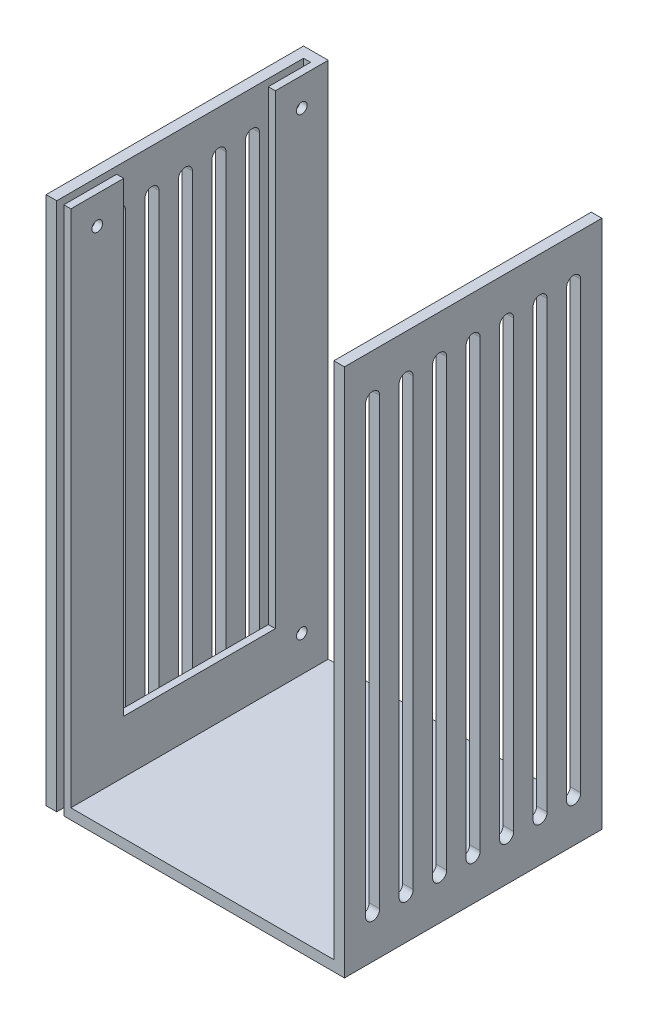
ISO-10303-21;
HEADER;
FILE_DESCRIPTION(('STEP AP214'),'2;1');
FILE_NAME('part.step','',(''),(''),'','','');
FILE_SCHEMA(('AUTOMOTIVE_DESIGN { 1 0 10303 214 1 1 1 1 }'));
ENDSEC;
DATA;
#1=APPLICATION_CONTEXT('core data for automotive mechanical design processes');
#2=APPLICATION_PROTOCOL_DEFINITION('international standard','automotive_design',2000,#1);
#3=PRODUCT_CONTEXT('',#1,'mechanical');
#4=PRODUCT('Part','Part','',(#3));
#5=PRODUCT_RELATED_PRODUCT_CATEGORY('part','',(#4));
#6=PRODUCT_DEFINITION_FORMATION('','',#4);
#7=PRODUCT_DEFINITION_CONTEXT('part definition',#1,'design');
#8=PRODUCT_DEFINITION('design','',#6,#7);
#9=PRODUCT_DEFINITION_SHAPE('','',#8);
#10=(LENGTH_UNIT() NAMED_UNIT(*) SI_UNIT(.MILLI.,.METRE.));
#11=(NAMED_UNIT(*) PLANE_ANGLE_UNIT() SI_UNIT($,.RADIAN.));
#12=(NAMED_UNIT(*) SI_UNIT($,.STERADIAN.) SOLID_ANGLE_UNIT());
#13=UNCERTAINTY_MEASURE_WITH_UNIT(LENGTH_MEASURE(1.E-05),#10,'distance_accuracy_value','');
#14=(GEOMETRIC_REPRESENTATION_CONTEXT(3) GLOBAL_UNCERTAINTY_ASSIGNED_CONTEXT((#13)) GLOBAL_UNIT_ASSIGNED_CONTEXT((#10,
#11,#12)) REPRESENTATION_CONTEXT('',''));
#15=CARTESIAN_POINT('',(0.,0.,0.));
#16=DIRECTION('',(0.,0.,1.));
#17=DIRECTION('',(1.,0.,0.));
#18=AXIS2_PLACEMENT_3D('',#15,#16,#17);
#19=CARTESIAN_POINT('',(0.,150.1,0.));
#20=DIRECTION('',(0.,1.,0.));
#21=DIRECTION('',(0.,0.,1.));
#22=AXIS2_PLACEMENT_3D('',#19,#20,#21);
#23=PLANE('',#22);
#24=DIRECTION('',(0.,0.,1.));
#25=VECTOR('',#24,1.);
#26=CARTESIAN_POINT('',(-530.362059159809,150.1,-39.3070739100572));
#27=LINE('',#26,#25);
#28=CARTESIAN_POINT('',(-530.362059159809,150.1,-39.3070739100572));
#29=VERTEX_POINT('',#28);
#30=CARTESIAN_POINT('',(-530.362059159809,150.1,-27.3070739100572));
#31=VERTEX_POINT('',#30);
#32=EDGE_CURVE('E504',#29,#31,#27,.T.);
#33=ORIENTED_EDGE('',*,*,#32,.T.);
#34=DIRECTION('',(1.,0.,0.));
#35=VECTOR('',#34,1.);
#36=CARTESIAN_POINT('',(-669.284375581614,150.1,-27.3070739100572));
#37=LINE('',#36,#35);
#38=CARTESIAN_POINT('',(-528.362059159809,150.1,-27.3070739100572));
#39=VERTEX_POINT('',#38);
#40=EDGE_CURVE('E491',#31,#39,#37,.T.);
#41=ORIENTED_EDGE('',*,*,#40,.T.);
#42=DIRECTION('',(0.,0.,-1.));
#43=VECTOR('',#42,1.);
#44=CARTESIAN_POINT('',(-528.362059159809,150.1,-42.3070739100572));
#45=LINE('',#44,#43);
#46=CARTESIAN_POINT('',(-528.362059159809,150.1,-42.3070739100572));
#47=VERTEX_POINT('',#46);
#48=EDGE_CURVE('E505',#39,#47,#45,.T.);
#49=ORIENTED_EDGE('',*,*,#48,.T.);
#50=DIRECTION('',(-1.,0.,0.));
#51=VECTOR('',#50,1.);
#52=CARTESIAN_POINT('',(-528.362059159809,150.1,-42.3070739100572));
#53=LINE('',#52,#51);
#54=CARTESIAN_POINT('',(-535.362059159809,150.1,-42.3070739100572));
#55=VERTEX_POINT('',#54);
#56=EDGE_CURVE('E519',#47,#55,#53,.T.);
#57=ORIENTED_EDGE('',*,*,#56,.T.);
#58=DIRECTION('',(0.,0.,1.));
#59=VECTOR('',#58,1.);
#60=CARTESIAN_POINT('',(-535.362059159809,150.1,-42.3070739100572));
#61=LINE('',#60,#59);
#62=CARTESIAN_POINT('',(-535.362059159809,150.1,30.6929260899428));
#63=VERTEX_POINT('',#62);
#64=EDGE_CURVE('E525',#55,#63,#61,.T.);
#65=ORIENTED_EDGE('',*,*,#64,.T.);
#66=DIRECTION('',(1.,0.,0.));
#67=VECTOR('',#66,1.);
#68=CARTESIAN_POINT('',(-535.362059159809,150.1,30.6929260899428));
#69=LINE('',#68,#67);
#70=CARTESIAN_POINT('',(-532.362059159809,150.1,30.6929260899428));
#71=VERTEX_POINT('',#70);
#72=EDGE_CURVE('E522',#63,#71,#69,.T.);
#73=ORIENTED_EDGE('',*,*,#72,.T.);
#74=DIRECTION('',(0.,0.,-1.));
#75=VECTOR('',#74,1.);
#76=CARTESIAN_POINT('',(-532.362059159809,150.1,30.6929260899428));
#77=LINE('',#76,#75);
#78=CARTESIAN_POINT('',(-532.362059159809,150.1,-39.3070739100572));
#79=VERTEX_POINT('',#78);
#80=EDGE_CURVE('E530',#71,#79,#77,.T.);
#81=ORIENTED_EDGE('',*,*,#80,.T.);
#82=DIRECTION('',(1.,0.,0.));
#83=VECTOR('',#82,1.);
#84=CARTESIAN_POINT('',(-532.362059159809,150.1,-39.3070739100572));
#85=LINE('',#84,#83);
#86=EDGE_CURVE('E529',#79,#29,#85,.T.);
#87=ORIENTED_EDGE('',*,*,#86,.T.);
#88=EDGE_LOOP('',(#33,#41,#49,#57,#65,#73,#81,#87));
#89=FACE_BOUND('',#88,.T.);
#90=ADVANCED_FACE('F41',(#89),#23,.T.);
#91=CARTESIAN_POINT('',(-528.362059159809,150.1,-42.3070739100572));
#92=DIRECTION('',(-1.,0.,0.));
#93=DIRECTION('',(0.,0.,1.));
#94=AXIS2_PLACEMENT_3D('',#91,#92,#93);
#95=PLANE('',#94);
#96=CARTESIAN_POINT('',(-528.362059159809,13.1,-34.8070739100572));
#97=DIRECTION('',(1.,0.,0.));
#98=DIRECTION('',(0.,0.,-1.));
#99=AXIS2_PLACEMENT_3D('',#96,#97,#98);
#100=CIRCLE('',#99,1.5);
#101=CARTESIAN_POINT('',(-528.362059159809,13.1,-36.3070739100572));
#102=VERTEX_POINT('',#101);
#103=EDGE_CURVE('E1066',#102,#102,#100,.T.);
#104=ORIENTED_EDGE('',*,*,#103,.F.);
#105=EDGE_LOOP('',(#104));
#106=FACE_BOUND('',#105,.T.);
#107=CARTESIAN_POINT('',(-528.362059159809,142.1,-34.8070739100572));
#108=DIRECTION('',(1.,0.,0.));
#109=DIRECTION('',(0.,0.,-1.));
#110=AXIS2_PLACEMENT_3D('',#107,#108,#109);
#111=CIRCLE('',#110,1.5);
#112=CARTESIAN_POINT('',(-528.362059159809,142.1,-36.3070739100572));
#113=VERTEX_POINT('',#112);
#114=EDGE_CURVE('E1074',#113,#113,#111,.T.);
#115=ORIENTED_EDGE('',*,*,#114,.F.);
#116=EDGE_LOOP('',(#115));
#117=FACE_BOUND('',#116,.T.);
#118=CARTESIAN_POINT('',(-528.362059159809,142.1,23.1929260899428));
#119=DIRECTION('',(1.,0.,0.));
#120=DIRECTION('',(0.,0.,-1.));
#121=AXIS2_PLACEMENT_3D('',#118,#119,#120);
#122=CIRCLE('',#121,1.5);
#123=CARTESIAN_POINT('',(-528.362059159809,142.1,21.6929260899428));
#124=VERTEX_POINT('',#123);
#125=EDGE_CURVE('E1085',#124,#124,#122,.T.);
#126=ORIENTED_EDGE('',*,*,#125,.F.);
#127=EDGE_LOOP('',(#126));
#128=FACE_BOUND('',#127,.T.);
#129=DIRECTION('',(0.,1.,0.));
#130=VECTOR('',#129,1.);
#131=CARTESIAN_POINT('',(-528.362059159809,150.1,-27.3070739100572));
#132=LINE('',#131,#130);
#133=CARTESIAN_POINT('',(-528.362059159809,18.,-27.3070739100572));
#134=VERTEX_POINT('',#133);
#135=EDGE_CURVE('E489',#134,#39,#132,.T.);
#136=ORIENTED_EDGE('',*,*,#135,.F.);
#137=DIRECTION('',(0.,0.,-1.));
#138=VECTOR('',#137,1.);
#139=CARTESIAN_POINT('',(-528.362059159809,18.,-27.3070739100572));
#140=LINE('',#139,#138);
#141=CARTESIAN_POINT('',(-528.362059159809,18.,15.6929260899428));
#142=VERTEX_POINT('',#141);
#143=EDGE_CURVE('E510',#142,#134,#140,.T.);
#144=ORIENTED_EDGE('',*,*,#143,.F.);
#145=DIRECTION('',(0.,-1.,0.));
#146=VECTOR('',#145,1.);
#147=CARTESIAN_POINT('',(-528.362059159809,150.1,15.6929260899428));
#148=LINE('',#147,#146);
#149=CARTESIAN_POINT('',(-528.362059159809,150.1,15.6929260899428));
#150=VERTEX_POINT('',#149);
#151=EDGE_CURVE('E498',#150,#142,#148,.T.);
#152=ORIENTED_EDGE('',*,*,#151,.F.);
#153=CARTESIAN_POINT('',(-528.362059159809,150.1,30.6929260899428));
#154=VERTEX_POINT('',#153);
#155=EDGE_CURVE('E511',#154,#150,#45,.T.);
#156=ORIENTED_EDGE('',*,*,#155,.F.);
#157=DIRECTION('',(0.,-1.,0.));
#158=VECTOR('',#157,1.);
#159=CARTESIAN_POINT('',(-528.362059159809,150.1,30.6929260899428));
#160=LINE('',#159,#158);
#161=CARTESIAN_POINT('',(-528.362059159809,3.,30.6929260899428));
#162=VERTEX_POINT('',#161);
#163=EDGE_CURVE('E557',#154,#162,#160,.T.);
#164=ORIENTED_EDGE('',*,*,#163,.T.);
#165=DIRECTION('',(0.,0.,-1.));
#166=VECTOR('',#165,1.);
#167=CARTESIAN_POINT('',(-528.362059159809,3.,30.6929260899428));
#168=LINE('',#167,#166);
#169=CARTESIAN_POINT('',(-528.362059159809,3.,-42.3070739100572));
#170=VERTEX_POINT('',#169);
#171=EDGE_CURVE('E566',#162,#170,#168,.T.);
#172=ORIENTED_EDGE('',*,*,#171,.T.);
#173=DIRECTION('',(0.,-1.,0.));
#174=VECTOR('',#173,1.);
#175=CARTESIAN_POINT('',(-528.362059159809,150.1,-42.3070739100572));
#176=LINE('',#175,#174);
#177=EDGE_CURVE('E515',#47,#170,#176,.T.);
#178=ORIENTED_EDGE('',*,*,#177,.F.);
#179=ORIENTED_EDGE('',*,*,#48,.F.);
#180=EDGE_LOOP('',(#136,#144,#152,#156,#164,#172,#178,#179));
#181=FACE_BOUND('',#180,.T.);
#182=ADVANCED_FACE('F508',(#106,#117,#128,#181),#95,.F.);
#183=CARTESIAN_POINT('',(-530.362059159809,150.1,-39.3070739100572));
#184=DIRECTION('',(1.,0.,0.));
#185=DIRECTION('',(0.,0.,-1.));
#186=AXIS2_PLACEMENT_3D('',#183,#184,#185);
#187=PLANE('',#186);
#188=CARTESIAN_POINT('',(-530.362059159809,13.1,-34.8070739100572));
#189=DIRECTION('',(1.,0.,0.));
#190=DIRECTION('',(0.,0.,-1.));
#191=AXIS2_PLACEMENT_3D('',#188,#189,#190);
#192=CIRCLE('',#191,1.5);
#193=CARTESIAN_POINT('',(-530.362059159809,13.1,-36.3070739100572));
#194=VERTEX_POINT('',#193);
#195=EDGE_CURVE('E893',#194,#194,#192,.T.);
#196=ORIENTED_EDGE('',*,*,#195,.T.);
#197=EDGE_LOOP('',(#196));
#198=FACE_BOUND('',#197,.T.);
#199=CARTESIAN_POINT('',(-530.362059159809,142.1,-34.8070739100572));
#200=DIRECTION('',(1.,0.,0.));
#201=DIRECTION('',(0.,0.,-1.));
#202=AXIS2_PLACEMENT_3D('',#199,#200,#201);
#203=CIRCLE('',#202,1.5);
#204=CARTESIAN_POINT('',(-530.362059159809,142.1,-36.3070739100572));
#205=VERTEX_POINT('',#204);
#206=EDGE_CURVE('E569',#205,#205,#203,.T.);
#207=ORIENTED_EDGE('',*,*,#206,.T.);
#208=EDGE_LOOP('',(#207));
#209=FACE_BOUND('',#208,.T.);
#210=CARTESIAN_POINT('',(-530.362059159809,142.1,23.1929260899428));
#211=DIRECTION('',(1.,0.,0.));
#212=DIRECTION('',(0.,0.,-1.));
#213=AXIS2_PLACEMENT_3D('',#210,#211,#212);
#214=CIRCLE('',#213,1.5);
#215=CARTESIAN_POINT('',(-530.362059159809,142.1,21.6929260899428));
#216=VERTEX_POINT('',#215);
#217=EDGE_CURVE('E574',#216,#216,#214,.T.);
#218=ORIENTED_EDGE('',*,*,#217,.T.);
#219=EDGE_LOOP('',(#218));
#220=FACE_BOUND('',#219,.T.);
#221=DIRECTION('',(0.,-1.,0.));
#222=VECTOR('',#221,1.);
#223=CARTESIAN_POINT('',(-530.362059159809,150.1,-27.3070739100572));
#224=LINE('',#223,#222);
#225=CARTESIAN_POINT('',(-530.362059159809,18.,-27.3070739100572));
#226=VERTEX_POINT('',#225);
#227=EDGE_CURVE('E862',#31,#226,#224,.T.);
#228=ORIENTED_EDGE('',*,*,#227,.F.);
#229=ORIENTED_EDGE('',*,*,#32,.F.);
#230=DIRECTION('',(0.,-1.,0.));
#231=VECTOR('',#230,1.);
#232=CARTESIAN_POINT('',(-530.362059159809,150.1,-39.3070739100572));
#233=LINE('',#232,#231);
#234=CARTESIAN_POINT('',(-530.362059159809,0.,-39.3070739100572));
#235=VERTEX_POINT('',#234);
#236=EDGE_CURVE('E532',#29,#235,#233,.T.);
#237=ORIENTED_EDGE('',*,*,#236,.T.);
#238=DIRECTION('',(0.,0.,1.));
#239=VECTOR('',#238,1.);
#240=CARTESIAN_POINT('',(-530.362059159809,0.,-39.3070739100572));
#241=LINE('',#240,#239);
#242=CARTESIAN_POINT('',(-530.362059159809,0.,30.6929260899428));
#243=VERTEX_POINT('',#242);
#244=EDGE_CURVE('E535',#235,#243,#241,.T.);
#245=ORIENTED_EDGE('',*,*,#244,.T.);
#246=DIRECTION('',(0.,-1.,0.));
#247=VECTOR('',#246,1.);
#248=CARTESIAN_POINT('',(-530.362059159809,150.1,30.6929260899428));
#249=LINE('',#248,#247);
#250=CARTESIAN_POINT('',(-530.362059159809,150.1,30.6929260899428));
#251=VERTEX_POINT('',#250);
#252=EDGE_CURVE('E563',#251,#243,#249,.T.);
#253=ORIENTED_EDGE('',*,*,#252,.F.);
#254=CARTESIAN_POINT('',(-530.362059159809,150.1,15.6929260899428));
#255=VERTEX_POINT('',#254);
#256=EDGE_CURVE('E543',#255,#251,#27,.T.);
#257=ORIENTED_EDGE('',*,*,#256,.F.);
#258=DIRECTION('',(0.,1.,0.));
#259=VECTOR('',#258,1.);
#260=CARTESIAN_POINT('',(-530.362059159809,150.1,15.6929260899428));
#261=LINE('',#260,#259);
#262=CARTESIAN_POINT('',(-530.362059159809,18.,15.6929260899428));
#263=VERTEX_POINT('',#262);
#264=EDGE_CURVE('E1087',#263,#255,#261,.T.);
#265=ORIENTED_EDGE('',*,*,#264,.F.);
#266=DIRECTION('',(0.,0.,1.));
#267=VECTOR('',#266,1.);
#268=CARTESIAN_POINT('',(-530.362059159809,18.,-27.3070739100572));
#269=LINE('',#268,#267);
#270=EDGE_CURVE('E1093',#226,#263,#269,.T.);
#271=ORIENTED_EDGE('',*,*,#270,.F.);
#272=EDGE_LOOP('',(#228,#229,#237,#245,#253,#257,#265,#271));
#273=FACE_BOUND('',#272,.T.);
#274=ADVANCED_FACE('F833',(#198,#209,#220,#273),#187,.F.);
#275=CARTESIAN_POINT('',(-453.762059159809,150.1,-42.3070739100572));
#276=DIRECTION('',(1.,0.,0.));
#277=DIRECTION('',(0.,0.,-1.));
#278=AXIS2_PLACEMENT_3D('',#275,#276,#277);
#279=PLANE('',#278);
#280=DIRECTION('',(0.,-1.,0.));
#281=VECTOR('',#280,1.);
#282=CARTESIAN_POINT('',(-453.762059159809,138.1,20.6929260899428));
#283=LINE('',#282,#281);
#284=CARTESIAN_POINT('',(-453.762059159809,138.1,20.6929260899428));
#285=VERTEX_POINT('',#284);
#286=CARTESIAN_POINT('',(-453.762059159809,12.,20.6929260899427));
#287=VERTEX_POINT('',#286);
#288=EDGE_CURVE('E590',#285,#287,#283,.T.);
#289=ORIENTED_EDGE('',*,*,#288,.F.);
#290=CARTESIAN_POINT('',(-453.762059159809,138.1,22.6929260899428));
#291=DIRECTION('',(1.,0.,0.));
#292=DIRECTION('',(0.,0.,-1.));
#293=AXIS2_PLACEMENT_3D('',#290,#291,#292);
#294=CIRCLE('',#293,2.);
#295=CARTESIAN_POINT('',(-453.762059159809,138.1,24.6929260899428));
#296=VERTEX_POINT('',#295);
#297=EDGE_CURVE('E593',#296,#285,#294,.F.);
#298=ORIENTED_EDGE('',*,*,#297,.F.);
#299=DIRECTION('',(0.,1.,0.));
#300=VECTOR('',#299,1.);
#301=CARTESIAN_POINT('',(-453.762059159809,138.1,24.6929260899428));
#302=LINE('',#301,#300);
#303=CARTESIAN_POINT('',(-453.762059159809,12.,24.6929260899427));
#304=VERTEX_POINT('',#303);
#305=EDGE_CURVE('E591',#304,#296,#302,.T.);
#306=ORIENTED_EDGE('',*,*,#305,.F.);
#307=CARTESIAN_POINT('',(-453.762059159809,12.,22.6929260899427));
#308=DIRECTION('',(1.,0.,0.));
#309=DIRECTION('',(0.,0.,-1.));
#310=AXIS2_PLACEMENT_3D('',#307,#308,#309);
#311=CIRCLE('',#310,2.);
#312=EDGE_CURVE('E583',#287,#304,#311,.F.);
#313=ORIENTED_EDGE('',*,*,#312,.F.);
#314=EDGE_LOOP('',(#289,#298,#306,#313));
#315=FACE_BOUND('',#314,.T.);
#316=DIRECTION('',(0.,-1.,0.));
#317=VECTOR('',#316,1.);
#318=CARTESIAN_POINT('',(-453.762059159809,138.1,11.1929260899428));
#319=LINE('',#318,#317);
#320=CARTESIAN_POINT('',(-453.762059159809,138.1,11.1929260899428));
#321=VERTEX_POINT('',#320);
#322=CARTESIAN_POINT('',(-453.762059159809,12.,11.1929260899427));
#323=VERTEX_POINT('',#322);
#324=EDGE_CURVE('E642',#321,#323,#319,.T.);
#325=ORIENTED_EDGE('',*,*,#324,.F.);
#326=CARTESIAN_POINT('',(-453.762059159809,138.1,13.1929260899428));
#327=DIRECTION('',(1.,0.,0.));
#328=DIRECTION('',(0.,0.,-1.));
#329=AXIS2_PLACEMENT_3D('',#326,#327,#328);
#330=CIRCLE('',#329,2.);
#331=CARTESIAN_POINT('',(-453.762059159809,138.1,15.1929260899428));
#332=VERTEX_POINT('',#331);
#333=EDGE_CURVE('E616',#332,#321,#330,.F.);
#334=ORIENTED_EDGE('',*,*,#333,.F.);
#335=DIRECTION('',(0.,1.,0.));
#336=VECTOR('',#335,1.);
#337=CARTESIAN_POINT('',(-453.762059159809,138.1,15.1929260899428));
#338=LINE('',#337,#336);
#339=CARTESIAN_POINT('',(-453.762059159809,12.,15.1929260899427));
#340=VERTEX_POINT('',#339);
#341=EDGE_CURVE('E618',#340,#332,#338,.T.);
#342=ORIENTED_EDGE('',*,*,#341,.F.);
#343=CARTESIAN_POINT('',(-453.762059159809,12.,13.1929260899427));
#344=DIRECTION('',(1.,0.,0.));
#345=DIRECTION('',(0.,0.,-1.));
#346=AXIS2_PLACEMENT_3D('',#343,#344,#345);
#347=CIRCLE('',#346,2.);
#348=EDGE_CURVE('E629',#323,#340,#347,.F.);
#349=ORIENTED_EDGE('',*,*,#348,.F.);
#350=EDGE_LOOP('',(#325,#334,#342,#349));
#351=FACE_BOUND('',#350,.T.);
#352=DIRECTION('',(0.,-1.,0.));
#353=VECTOR('',#352,1.);
#354=CARTESIAN_POINT('',(-453.762059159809,138.1,1.69292608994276));
#355=LINE('',#354,#353);
#356=CARTESIAN_POINT('',(-453.762059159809,138.1,1.69292608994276));
#357=VERTEX_POINT('',#356);
#358=CARTESIAN_POINT('',(-453.762059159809,12.,1.69292608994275));
#359=VERTEX_POINT('',#358);
#360=EDGE_CURVE('E668',#357,#359,#355,.T.);
#361=ORIENTED_EDGE('',*,*,#360,.F.);
#362=CARTESIAN_POINT('',(-453.762059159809,138.1,3.69292608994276));
#363=DIRECTION('',(1.,0.,0.));
#364=DIRECTION('',(0.,0.,-1.));
#365=AXIS2_PLACEMENT_3D('',#362,#363,#364);
#366=CIRCLE('',#365,2.);
#367=CARTESIAN_POINT('',(-453.762059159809,138.1,5.69292608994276));
#368=VERTEX_POINT('',#367);
#369=EDGE_CURVE('E650',#368,#357,#366,.F.);
#370=ORIENTED_EDGE('',*,*,#369,.F.);
#371=DIRECTION('',(0.,1.,0.));
#372=VECTOR('',#371,1.);
#373=CARTESIAN_POINT('',(-453.762059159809,138.1,5.69292608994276));
#374=LINE('',#373,#372);
#375=CARTESIAN_POINT('',(-453.762059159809,12.,5.69292608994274));
#376=VERTEX_POINT('',#375);
#377=EDGE_CURVE('E643',#376,#368,#374,.T.);
#378=ORIENTED_EDGE('',*,*,#377,.F.);
#379=CARTESIAN_POINT('',(-453.762059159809,12.,3.69292608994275));
#380=DIRECTION('',(1.,0.,0.));
#381=DIRECTION('',(0.,0.,-1.));
#382=AXIS2_PLACEMENT_3D('',#379,#380,#381);
#383=CIRCLE('',#382,2.);
#384=EDGE_CURVE('E659',#359,#376,#383,.F.);
#385=ORIENTED_EDGE('',*,*,#384,.F.);
#386=EDGE_LOOP('',(#361,#370,#378,#385));
#387=FACE_BOUND('',#386,.T.);
#388=DIRECTION('',(0.,-1.,0.));
#389=VECTOR('',#388,1.);
#390=CARTESIAN_POINT('',(-453.762059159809,138.1,-7.80707391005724));
#391=LINE('',#390,#389);
#392=CARTESIAN_POINT('',(-453.762059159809,138.1,-7.80707391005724));
#393=VERTEX_POINT('',#392);
#394=CARTESIAN_POINT('',(-453.762059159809,12.,-7.80707391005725));
#395=VERTEX_POINT('',#394);
#396=EDGE_CURVE('E697',#393,#395,#391,.T.);
#397=ORIENTED_EDGE('',*,*,#396,.F.);
#398=CARTESIAN_POINT('',(-453.762059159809,138.1,-5.80707391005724));
#399=DIRECTION('',(1.,0.,0.));
#400=DIRECTION('',(0.,0.,-1.));
#401=AXIS2_PLACEMENT_3D('',#398,#399,#400);
#402=CIRCLE('',#401,2.);
#403=CARTESIAN_POINT('',(-453.762059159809,138.1,-3.80707391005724));
#404=VERTEX_POINT('',#403);
#405=EDGE_CURVE('E678',#404,#393,#402,.F.);
#406=ORIENTED_EDGE('',*,*,#405,.F.);
#407=DIRECTION('',(0.,1.,0.));
#408=VECTOR('',#407,1.);
#409=CARTESIAN_POINT('',(-453.762059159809,138.1,-3.80707391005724));
#410=LINE('',#409,#408);
#411=CARTESIAN_POINT('',(-453.762059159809,12.,-3.80707391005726));
#412=VERTEX_POINT('',#411);
#413=EDGE_CURVE('E673',#412,#404,#410,.T.);
#414=ORIENTED_EDGE('',*,*,#413,.F.);
#415=CARTESIAN_POINT('',(-453.762059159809,12.,-5.80707391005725));
#416=DIRECTION('',(1.,0.,0.));
#417=DIRECTION('',(0.,0.,-1.));
#418=AXIS2_PLACEMENT_3D('',#415,#416,#417);
#419=CIRCLE('',#418,2.);
#420=EDGE_CURVE('E686',#395,#412,#419,.F.);
#421=ORIENTED_EDGE('',*,*,#420,.F.);
#422=EDGE_LOOP('',(#397,#406,#414,#421));
#423=FACE_BOUND('',#422,.T.);
#424=DIRECTION('',(0.,-1.,0.));
#425=VECTOR('',#424,1.);
#426=CARTESIAN_POINT('',(-453.762059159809,138.1,-17.3070739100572));
#427=LINE('',#426,#425);
#428=CARTESIAN_POINT('',(-453.762059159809,138.1,-17.3070739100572));
#429=VERTEX_POINT('',#428);
#430=CARTESIAN_POINT('',(-453.762059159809,12.,-17.3070739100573));
#431=VERTEX_POINT('',#430);
#432=EDGE_CURVE('E726',#429,#431,#427,.T.);
#433=ORIENTED_EDGE('',*,*,#432,.F.);
#434=CARTESIAN_POINT('',(-453.762059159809,138.1,-15.3070739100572));
#435=DIRECTION('',(1.,0.,0.));
#436=DIRECTION('',(0.,0.,-1.));
#437=AXIS2_PLACEMENT_3D('',#434,#435,#436);
#438=CIRCLE('',#437,2.);
#439=CARTESIAN_POINT('',(-453.762059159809,138.1,-13.3070739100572));
#440=VERTEX_POINT('',#439);
#441=EDGE_CURVE('E704',#440,#429,#438,.F.);
#442=ORIENTED_EDGE('',*,*,#441,.F.);
#443=DIRECTION('',(0.,1.,0.));
#444=VECTOR('',#443,1.);
#445=CARTESIAN_POINT('',(-453.762059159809,138.1,-13.3070739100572));
#446=LINE('',#445,#444);
#447=CARTESIAN_POINT('',(-453.762059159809,12.,-13.3070739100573));
#448=VERTEX_POINT('',#447);
#449=EDGE_CURVE('E702',#448,#440,#446,.T.);
#450=ORIENTED_EDGE('',*,*,#449,.F.);
#451=CARTESIAN_POINT('',(-453.762059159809,12.,-15.3070739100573));
#452=DIRECTION('',(1.,0.,0.));
#453=DIRECTION('',(0.,0.,-1.));
#454=AXIS2_PLACEMENT_3D('',#451,#452,#453);
#455=CIRCLE('',#454,2.);
#456=EDGE_CURVE('E716',#431,#448,#455,.F.);
#457=ORIENTED_EDGE('',*,*,#456,.F.);
#458=EDGE_LOOP('',(#433,#442,#450,#457));
#459=FACE_BOUND('',#458,.T.);
#460=DIRECTION('',(0.,-1.,0.));
#461=VECTOR('',#460,1.);
#462=CARTESIAN_POINT('',(-453.762059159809,138.1,-26.8070739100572));
#463=LINE('',#462,#461);
#464=CARTESIAN_POINT('',(-453.762059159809,138.1,-26.8070739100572));
#465=VERTEX_POINT('',#464);
#466=CARTESIAN_POINT('',(-453.762059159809,12.,-26.8070739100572));
#467=VERTEX_POINT('',#466);
#468=EDGE_CURVE('E760',#465,#467,#463,.T.);
#469=ORIENTED_EDGE('',*,*,#468,.F.);
#470=CARTESIAN_POINT('',(-453.762059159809,138.1,-24.8070739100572));
#471=DIRECTION('',(1.,0.,0.));
#472=DIRECTION('',(0.,0.,-1.));
#473=AXIS2_PLACEMENT_3D('',#470,#471,#472);
#474=CIRCLE('',#473,2.);
#475=CARTESIAN_POINT('',(-453.762059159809,138.1,-22.8070739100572));
#476=VERTEX_POINT('',#475);
#477=EDGE_CURVE('E731',#476,#465,#474,.F.);
#478=ORIENTED_EDGE('',*,*,#477,.F.);
#479=DIRECTION('',(0.,1.,0.));
#480=VECTOR('',#479,1.);
#481=CARTESIAN_POINT('',(-453.762059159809,138.1,-22.8070739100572));
#482=LINE('',#481,#480);
#483=CARTESIAN_POINT('',(-453.762059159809,12.,-22.8070739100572));
#484=VERTEX_POINT('',#483);
#485=EDGE_CURVE('E735',#484,#476,#482,.T.);
#486=ORIENTED_EDGE('',*,*,#485,.F.);
#487=CARTESIAN_POINT('',(-453.762059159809,12.,-24.8070739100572));
#488=DIRECTION('',(1.,0.,0.));
#489=DIRECTION('',(0.,0.,-1.));
#490=AXIS2_PLACEMENT_3D('',#487,#488,#489);
#491=CIRCLE('',#490,2.);
#492=EDGE_CURVE('E748',#467,#484,#491,.F.);
#493=ORIENTED_EDGE('',*,*,#492,.F.);
#494=EDGE_LOOP('',(#469,#478,#486,#493));
#495=FACE_BOUND('',#494,.T.);
#496=DIRECTION('',(0.,-1.,0.));
#497=VECTOR('',#496,1.);
#498=CARTESIAN_POINT('',(-453.762059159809,138.1,-36.3070739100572));
#499=LINE('',#498,#497);
#500=CARTESIAN_POINT('',(-453.762059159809,138.1,-36.3070739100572));
#501=VERTEX_POINT('',#500);
#502=CARTESIAN_POINT('',(-453.762059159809,12.,-36.3070739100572));
#503=VERTEX_POINT('',#502);
#504=EDGE_CURVE('E783',#501,#503,#499,.T.);
#505=ORIENTED_EDGE('',*,*,#504,.F.);
#506=CARTESIAN_POINT('',(-453.762059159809,138.1,-34.3070739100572));
#507=DIRECTION('',(1.,0.,0.));
#508=DIRECTION('',(0.,0.,-1.));
#509=AXIS2_PLACEMENT_3D('',#506,#507,#508);
#510=CIRCLE('',#509,2.);
#511=CARTESIAN_POINT('',(-453.762059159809,138.1,-32.3070739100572));
#512=VERTEX_POINT('',#511);
#513=EDGE_CURVE('E765',#512,#501,#510,.F.);
#514=ORIENTED_EDGE('',*,*,#513,.F.);
#515=DIRECTION('',(0.,1.,0.));
#516=VECTOR('',#515,1.);
#517=CARTESIAN_POINT('',(-453.762059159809,138.1,-32.3070739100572));
#518=LINE('',#517,#516);
#519=CARTESIAN_POINT('',(-453.762059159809,12.,-32.3070739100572));
#520=VERTEX_POINT('',#519);
#521=EDGE_CURVE('E581',#520,#512,#518,.T.);
#522=ORIENTED_EDGE('',*,*,#521,.F.);
#523=CARTESIAN_POINT('',(-453.762059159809,12.,-34.3070739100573));
#524=DIRECTION('',(1.,0.,0.));
#525=DIRECTION('',(0.,0.,-1.));
#526=AXIS2_PLACEMENT_3D('',#523,#524,#525);
#527=CIRCLE('',#526,2.);
#528=EDGE_CURVE('E774',#503,#520,#527,.F.);
#529=ORIENTED_EDGE('',*,*,#528,.F.);
#530=EDGE_LOOP('',(#505,#514,#522,#529));
#531=FACE_BOUND('',#530,.T.);
#532=DIRECTION('',(0.,-1.,0.));
#533=VECTOR('',#532,1.);
#534=CARTESIAN_POINT('',(-453.762059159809,150.1,-42.3070739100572));
#535=LINE('',#534,#533);
#536=CARTESIAN_POINT('',(-453.762059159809,150.1,-42.3070739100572));
#537=VERTEX_POINT('',#536);
#538=CARTESIAN_POINT('',(-453.762059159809,3.,-42.3070739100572));
#539=VERTEX_POINT('',#538);
#540=EDGE_CURVE('E797',#537,#539,#535,.T.);
#541=ORIENTED_EDGE('',*,*,#540,.T.);
#542=DIRECTION('',(0.,0.,1.));
#543=VECTOR('',#542,1.);
#544=CARTESIAN_POINT('',(-453.762059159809,3.,30.6929260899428));
#545=LINE('',#544,#543);
#546=CARTESIAN_POINT('',(-453.762059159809,3.,30.6929260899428));
#547=VERTEX_POINT('',#546);
#548=EDGE_CURVE('E582',#539,#547,#545,.T.);
#549=ORIENTED_EDGE('',*,*,#548,.T.);
#550=DIRECTION('',(0.,-1.,0.));
#551=VECTOR('',#550,1.);
#552=CARTESIAN_POINT('',(-453.762059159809,150.1,30.6929260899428));
#553=LINE('',#552,#551);
#554=CARTESIAN_POINT('',(-453.762059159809,150.1,30.6929260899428));
#555=VERTEX_POINT('',#554);
#556=EDGE_CURVE('E612',#555,#547,#553,.T.);
#557=ORIENTED_EDGE('',*,*,#556,.F.);
#558=DIRECTION('',(0.,0.,1.));
#559=VECTOR('',#558,1.);
#560=CARTESIAN_POINT('',(-453.762059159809,150.1,-42.3070739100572));
#561=LINE('',#560,#559);
#562=EDGE_CURVE('E44',#537,#555,#561,.T.);
#563=ORIENTED_EDGE('',*,*,#562,.F.);
#564=EDGE_LOOP('',(#541,#549,#557,#563));
#565=FACE_BOUND('',#564,.T.);
#566=ADVANCED_FACE('F815',(#315,#351,#387,#423,#459,#495,#531,#565),#279,.F.);
#567=CARTESIAN_POINT('',(-453.762059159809,150.1,30.6929260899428));
#568=DIRECTION('',(0.,0.,-1.));
#569=DIRECTION('',(-1.,0.,0.));
#570=AXIS2_PLACEMENT_3D('',#567,#568,#569);
#571=PLANE('',#570);
#572=DIRECTION('',(1.,0.,0.));
#573=VECTOR('',#572,1.);
#574=CARTESIAN_POINT('',(-453.762059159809,0.,30.6929260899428));
#575=LINE('',#574,#573);
#576=CARTESIAN_POINT('',(-450.762059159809,0.,30.6929260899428));
#577=VERTEX_POINT('',#576);
#578=EDGE_CURVE('E11',#243,#577,#575,.T.);
#579=ORIENTED_EDGE('',*,*,#578,.T.);
#580=DIRECTION('',(0.,-1.,0.));
#581=VECTOR('',#580,1.);
#582=CARTESIAN_POINT('',(-450.762059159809,150.1,30.6929260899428));
#583=LINE('',#582,#581);
#584=CARTESIAN_POINT('',(-450.762059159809,150.1,30.6929260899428));
#585=VERTEX_POINT('',#584);
#586=EDGE_CURVE('E787',#585,#577,#583,.T.);
#587=ORIENTED_EDGE('',*,*,#586,.F.);
#588=DIRECTION('',(1.,0.,0.));
#589=VECTOR('',#588,1.);
#590=CARTESIAN_POINT('',(-453.762059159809,150.1,30.6929260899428));
#591=LINE('',#590,#589);
#592=EDGE_CURVE('E802',#555,#585,#591,.T.);
#593=ORIENTED_EDGE('',*,*,#592,.F.);
#594=ORIENTED_EDGE('',*,*,#556,.T.);
#595=DIRECTION('',(-1.,0.,0.));
#596=VECTOR('',#595,1.);
#597=CARTESIAN_POINT('',(-528.362059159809,3.,30.6929260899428));
#598=LINE('',#597,#596);
#599=EDGE_CURVE('E69',#547,#162,#598,.T.);
#600=ORIENTED_EDGE('',*,*,#599,.T.);
#601=ORIENTED_EDGE('',*,*,#163,.F.);
#602=DIRECTION('',(1.,0.,0.));
#603=VECTOR('',#602,1.);
#604=CARTESIAN_POINT('',(-530.362059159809,150.1,30.6929260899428));
#605=LINE('',#604,#603);
#606=EDGE_CURVE('E513',#251,#154,#605,.T.);
#607=ORIENTED_EDGE('',*,*,#606,.F.);
#608=ORIENTED_EDGE('',*,*,#252,.T.);
#609=EDGE_LOOP('',(#579,#587,#593,#594,#600,#601,#607,#608));
#610=FACE_BOUND('',#609,.T.);
#611=ADVANCED_FACE('F818',(#610),#571,.F.);
#612=CARTESIAN_POINT('',(-450.762059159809,150.1,-42.3070739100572));
#613=DIRECTION('',(-1.,0.,0.));
#614=DIRECTION('',(0.,0.,1.));
#615=AXIS2_PLACEMENT_3D('',#612,#613,#614);
#616=PLANE('',#615);
#617=DIRECTION('',(0.,-1.,0.));
#618=VECTOR('',#617,1.);
#619=CARTESIAN_POINT('',(-450.762059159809,138.1,24.6929260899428));
#620=LINE('',#619,#618);
#621=CARTESIAN_POINT('',(-450.762059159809,138.1,24.6929260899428));
#622=VERTEX_POINT('',#621);
#623=CARTESIAN_POINT('',(-450.762059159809,12.,24.6929260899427));
#624=VERTEX_POINT('',#623);
#625=EDGE_CURVE('E597',#622,#624,#620,.T.);
#626=ORIENTED_EDGE('',*,*,#625,.F.);
#627=CARTESIAN_POINT('',(-450.762059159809,138.1,22.6929260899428));
#628=DIRECTION('',(1.,0.,0.));
#629=DIRECTION('',(0.,0.,1.));
#630=AXIS2_PLACEMENT_3D('',#627,#628,#629);
#631=CIRCLE('',#630,2.);
#632=CARTESIAN_POINT('',(-450.762059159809,138.1,20.6929260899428));
#633=VERTEX_POINT('',#632);
#634=EDGE_CURVE('E594',#633,#622,#631,.T.);
#635=ORIENTED_EDGE('',*,*,#634,.F.);
#636=DIRECTION('',(0.,1.,0.));
#637=VECTOR('',#636,1.);
#638=CARTESIAN_POINT('',(-450.762059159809,138.1,20.6929260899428));
#639=LINE('',#638,#637);
#640=CARTESIAN_POINT('',(-450.762059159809,12.,20.6929260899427));
#641=VERTEX_POINT('',#640);
#642=EDGE_CURVE('E604',#641,#633,#639,.T.);
#643=ORIENTED_EDGE('',*,*,#642,.F.);
#644=CARTESIAN_POINT('',(-450.762059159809,12.,22.6929260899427));
#645=DIRECTION('',(1.,0.,0.));
#646=DIRECTION('',(0.,0.,-1.));
#647=AXIS2_PLACEMENT_3D('',#644,#645,#646);
#648=CIRCLE('',#647,2.);
#649=EDGE_CURVE('E598',#624,#641,#648,.T.);
#650=ORIENTED_EDGE('',*,*,#649,.F.);
#651=EDGE_LOOP('',(#626,#635,#643,#650));
#652=FACE_BOUND('',#651,.T.);
#653=DIRECTION('',(0.,-1.,0.));
#654=VECTOR('',#653,1.);
#655=CARTESIAN_POINT('',(-450.762059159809,138.1,15.1929260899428));
#656=LINE('',#655,#654);
#657=CARTESIAN_POINT('',(-450.762059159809,138.1,15.1929260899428));
#658=VERTEX_POINT('',#657);
#659=CARTESIAN_POINT('',(-450.762059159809,12.,15.1929260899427));
#660=VERTEX_POINT('',#659);
#661=EDGE_CURVE('E636',#658,#660,#656,.T.);
#662=ORIENTED_EDGE('',*,*,#661,.F.);
#663=CARTESIAN_POINT('',(-450.762059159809,138.1,13.1929260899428));
#664=DIRECTION('',(1.,0.,0.));
#665=DIRECTION('',(0.,0.,1.));
#666=AXIS2_PLACEMENT_3D('',#663,#664,#665);
#667=CIRCLE('',#666,2.);
#668=CARTESIAN_POINT('',(-450.762059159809,138.1,11.1929260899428));
#669=VERTEX_POINT('',#668);
#670=EDGE_CURVE('E600',#669,#658,#667,.T.);
#671=ORIENTED_EDGE('',*,*,#670,.F.);
#672=DIRECTION('',(0.,1.,0.));
#673=VECTOR('',#672,1.);
#674=CARTESIAN_POINT('',(-450.762059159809,138.1,11.1929260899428));
#675=LINE('',#674,#673);
#676=CARTESIAN_POINT('',(-450.762059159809,12.,11.1929260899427));
#677=VERTEX_POINT('',#676);
#678=EDGE_CURVE('E621',#677,#669,#675,.T.);
#679=ORIENTED_EDGE('',*,*,#678,.F.);
#680=CARTESIAN_POINT('',(-450.762059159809,12.,13.1929260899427));
#681=DIRECTION('',(1.,0.,0.));
#682=DIRECTION('',(0.,0.,-1.));
#683=AXIS2_PLACEMENT_3D('',#680,#681,#682);
#684=CIRCLE('',#683,2.);
#685=EDGE_CURVE('E633',#660,#677,#684,.T.);
#686=ORIENTED_EDGE('',*,*,#685,.F.);
#687=EDGE_LOOP('',(#662,#671,#679,#686));
#688=FACE_BOUND('',#687,.T.);
#689=DIRECTION('',(0.,-1.,0.));
#690=VECTOR('',#689,1.);
#691=CARTESIAN_POINT('',(-450.762059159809,138.1,5.69292608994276));
#692=LINE('',#691,#690);
#693=CARTESIAN_POINT('',(-450.762059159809,138.1,5.69292608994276));
#694=VERTEX_POINT('',#693);
#695=CARTESIAN_POINT('',(-450.762059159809,12.,5.69292608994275));
#696=VERTEX_POINT('',#695);
#697=EDGE_CURVE('E663',#694,#696,#692,.T.);
#698=ORIENTED_EDGE('',*,*,#697,.F.);
#699=CARTESIAN_POINT('',(-450.762059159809,138.1,3.69292608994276));
#700=DIRECTION('',(1.,0.,0.));
#701=DIRECTION('',(0.,0.,1.));
#702=AXIS2_PLACEMENT_3D('',#699,#700,#701);
#703=CIRCLE('',#702,2.);
#704=CARTESIAN_POINT('',(-450.762059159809,138.1,1.69292608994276));
#705=VERTEX_POINT('',#704);
#706=EDGE_CURVE('E620',#705,#694,#703,.T.);
#707=ORIENTED_EDGE('',*,*,#706,.F.);
#708=DIRECTION('',(0.,1.,0.));
#709=VECTOR('',#708,1.);
#710=CARTESIAN_POINT('',(-450.762059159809,138.1,1.69292608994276));
#711=LINE('',#710,#709);
#712=CARTESIAN_POINT('',(-450.762059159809,12.,1.69292608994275));
#713=VERTEX_POINT('',#712);
#714=EDGE_CURVE('E651',#713,#705,#711,.T.);
#715=ORIENTED_EDGE('',*,*,#714,.F.);
#716=CARTESIAN_POINT('',(-450.762059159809,12.,3.69292608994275));
#717=DIRECTION('',(1.,0.,0.));
#718=DIRECTION('',(0.,0.,-1.));
#719=AXIS2_PLACEMENT_3D('',#716,#717,#718);
#720=CIRCLE('',#719,2.);
#721=EDGE_CURVE('E665',#696,#713,#720,.T.);
#722=ORIENTED_EDGE('',*,*,#721,.F.);
#723=EDGE_LOOP('',(#698,#707,#715,#722));
#724=FACE_BOUND('',#723,.T.);
#725=DIRECTION('',(0.,-1.,0.));
#726=VECTOR('',#725,1.);
#727=CARTESIAN_POINT('',(-450.762059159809,138.1,-3.80707391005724));
#728=LINE('',#727,#726);
#729=CARTESIAN_POINT('',(-450.762059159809,138.1,-3.80707391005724));
#730=VERTEX_POINT('',#729);
#731=CARTESIAN_POINT('',(-450.762059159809,12.,-3.80707391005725));
#732=VERTEX_POINT('',#731);
#733=EDGE_CURVE('E692',#730,#732,#728,.T.);
#734=ORIENTED_EDGE('',*,*,#733,.F.);
#735=CARTESIAN_POINT('',(-450.762059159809,138.1,-5.80707391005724));
#736=DIRECTION('',(1.,0.,0.));
#737=DIRECTION('',(0.,0.,1.));
#738=AXIS2_PLACEMENT_3D('',#735,#736,#737);
#739=CIRCLE('',#738,2.);
#740=CARTESIAN_POINT('',(-450.762059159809,138.1,-7.80707391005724));
#741=VERTEX_POINT('',#740);
#742=EDGE_CURVE('E649',#741,#730,#739,.T.);
#743=ORIENTED_EDGE('',*,*,#742,.F.);
#744=DIRECTION('',(0.,1.,0.));
#745=VECTOR('',#744,1.);
#746=CARTESIAN_POINT('',(-450.762059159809,138.1,-7.80707391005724));
#747=LINE('',#746,#745);
#748=CARTESIAN_POINT('',(-450.762059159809,12.,-7.80707391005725));
#749=VERTEX_POINT('',#748);
#750=EDGE_CURVE('E683',#749,#741,#747,.T.);
#751=ORIENTED_EDGE('',*,*,#750,.F.);
#752=CARTESIAN_POINT('',(-450.762059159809,12.,-5.80707391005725));
#753=DIRECTION('',(1.,0.,0.));
#754=DIRECTION('',(0.,0.,-1.));
#755=AXIS2_PLACEMENT_3D('',#752,#753,#754);
#756=CIRCLE('',#755,2.);
#757=EDGE_CURVE('E691',#732,#749,#756,.T.);
#758=ORIENTED_EDGE('',*,*,#757,.F.);
#759=EDGE_LOOP('',(#734,#743,#751,#758));
#760=FACE_BOUND('',#759,.T.);
#761=DIRECTION('',(0.,-1.,0.));
#762=VECTOR('',#761,1.);
#763=CARTESIAN_POINT('',(-450.762059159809,138.1,-13.3070739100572));
#764=LINE('',#763,#762);
#765=CARTESIAN_POINT('',(-450.762059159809,138.1,-13.3070739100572));
#766=VERTEX_POINT('',#765);
#767=CARTESIAN_POINT('',(-450.762059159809,12.,-13.3070739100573));
#768=VERTEX_POINT('',#767);
#769=EDGE_CURVE('E721',#766,#768,#764,.T.);
#770=ORIENTED_EDGE('',*,*,#769,.F.);
#771=CARTESIAN_POINT('',(-450.762059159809,138.1,-15.3070739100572));
#772=DIRECTION('',(1.,0.,0.));
#773=DIRECTION('',(0.,0.,1.));
#774=AXIS2_PLACEMENT_3D('',#771,#772,#773);
#775=CIRCLE('',#774,2.);
#776=CARTESIAN_POINT('',(-450.762059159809,138.1,-17.3070739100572));
#777=VERTEX_POINT('',#776);
#778=EDGE_CURVE('E680',#777,#766,#775,.T.);
#779=ORIENTED_EDGE('',*,*,#778,.F.);
#780=DIRECTION('',(0.,1.,0.));
#781=VECTOR('',#780,1.);
#782=CARTESIAN_POINT('',(-450.762059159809,138.1,-17.3070739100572));
#783=LINE('',#782,#781);
#784=CARTESIAN_POINT('',(-450.762059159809,12.,-17.3070739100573));
#785=VERTEX_POINT('',#784);
#786=EDGE_CURVE('E708',#785,#777,#783,.T.);
#787=ORIENTED_EDGE('',*,*,#786,.F.);
#788=CARTESIAN_POINT('',(-450.762059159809,12.,-15.3070739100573));
#789=DIRECTION('',(1.,0.,0.));
#790=DIRECTION('',(0.,0.,-1.));
#791=AXIS2_PLACEMENT_3D('',#788,#789,#790);
#792=CIRCLE('',#791,2.);
#793=EDGE_CURVE('E717',#768,#785,#792,.T.);
#794=ORIENTED_EDGE('',*,*,#793,.F.);
#795=EDGE_LOOP('',(#770,#779,#787,#794));
#796=FACE_BOUND('',#795,.T.);
#797=DIRECTION('',(0.,-1.,0.));
#798=VECTOR('',#797,1.);
#799=CARTESIAN_POINT('',(-450.762059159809,138.1,-22.8070739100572));
#800=LINE('',#799,#798);
#801=CARTESIAN_POINT('',(-450.762059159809,138.1,-22.8070739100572));
#802=VERTEX_POINT('',#801);
#803=CARTESIAN_POINT('',(-450.762059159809,12.,-22.8070739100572));
#804=VERTEX_POINT('',#803);
#805=EDGE_CURVE('E755',#802,#804,#800,.T.);
#806=ORIENTED_EDGE('',*,*,#805,.F.);
#807=CARTESIAN_POINT('',(-450.762059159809,138.1,-24.8070739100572));
#808=DIRECTION('',(1.,0.,0.));
#809=DIRECTION('',(0.,0.,1.));
#810=AXIS2_PLACEMENT_3D('',#807,#808,#809);
#811=CIRCLE('',#810,2.);
#812=CARTESIAN_POINT('',(-450.762059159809,138.1,-26.8070739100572));
#813=VERTEX_POINT('',#812);
#814=EDGE_CURVE('E707',#813,#802,#811,.T.);
#815=ORIENTED_EDGE('',*,*,#814,.F.);
#816=DIRECTION('',(0.,1.,0.));
#817=VECTOR('',#816,1.);
#818=CARTESIAN_POINT('',(-450.762059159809,138.1,-26.8070739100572));
#819=LINE('',#818,#817);
#820=CARTESIAN_POINT('',(-450.762059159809,12.,-26.8070739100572));
#821=VERTEX_POINT('',#820);
#822=EDGE_CURVE('E738',#821,#813,#819,.T.);
#823=ORIENTED_EDGE('',*,*,#822,.F.);
#824=CARTESIAN_POINT('',(-450.762059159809,12.,-24.8070739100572));
#825=DIRECTION('',(1.,0.,0.));
#826=DIRECTION('',(0.,0.,-1.));
#827=AXIS2_PLACEMENT_3D('',#824,#825,#826);
#828=CIRCLE('',#827,2.);
#829=EDGE_CURVE('E750',#804,#821,#828,.T.);
#830=ORIENTED_EDGE('',*,*,#829,.F.);
#831=EDGE_LOOP('',(#806,#815,#823,#830));
#832=FACE_BOUND('',#831,.T.);
#833=DIRECTION('',(0.,-1.,0.));
#834=VECTOR('',#833,1.);
#835=CARTESIAN_POINT('',(-450.762059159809,138.1,-32.3070739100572));
#836=LINE('',#835,#834);
#837=CARTESIAN_POINT('',(-450.762059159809,138.1,-32.3070739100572));
#838=VERTEX_POINT('',#837);
#839=CARTESIAN_POINT('',(-450.762059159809,12.,-32.3070739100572));
#840=VERTEX_POINT('',#839);
#841=EDGE_CURVE('E776',#838,#840,#836,.T.);
#842=ORIENTED_EDGE('',*,*,#841,.F.);
#843=CARTESIAN_POINT('',(-450.762059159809,138.1,-34.3070739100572));
#844=DIRECTION('',(1.,0.,0.));
#845=DIRECTION('',(0.,0.,1.));
#846=AXIS2_PLACEMENT_3D('',#843,#844,#845);
#847=CIRCLE('',#846,2.);
#848=CARTESIAN_POINT('',(-450.762059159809,138.1,-36.3070739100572));
#849=VERTEX_POINT('',#848);
#850=EDGE_CURVE('E733',#849,#838,#847,.T.);
#851=ORIENTED_EDGE('',*,*,#850,.F.);
#852=DIRECTION('',(0.,1.,0.));
#853=VECTOR('',#852,1.);
#854=CARTESIAN_POINT('',(-450.762059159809,138.1,-36.3070739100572));
#855=LINE('',#854,#853);
#856=CARTESIAN_POINT('',(-450.762059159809,12.,-36.3070739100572));
#857=VERTEX_POINT('',#856);
#858=EDGE_CURVE('E766',#857,#849,#855,.T.);
#859=ORIENTED_EDGE('',*,*,#858,.F.);
#860=CARTESIAN_POINT('',(-450.762059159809,12.,-34.3070739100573));
#861=DIRECTION('',(1.,0.,0.));
#862=DIRECTION('',(0.,0.,-1.));
#863=AXIS2_PLACEMENT_3D('',#860,#861,#862);
#864=CIRCLE('',#863,2.);
#865=EDGE_CURVE('E777',#840,#857,#864,.T.);
#866=ORIENTED_EDGE('',*,*,#865,.F.);
#867=EDGE_LOOP('',(#842,#851,#859,#866));
#868=FACE_BOUND('',#867,.T.);
#869=DIRECTION('',(0.,0.,-1.));
#870=VECTOR('',#869,1.);
#871=CARTESIAN_POINT('',(-450.762059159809,0.,-42.3070739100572));
#872=LINE('',#871,#870);
#873=CARTESIAN_POINT('',(-450.762059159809,0.,-42.3070739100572));
#874=VERTEX_POINT('',#873);
#875=EDGE_CURVE('E49',#577,#874,#872,.T.);
#876=ORIENTED_EDGE('',*,*,#875,.T.);
#877=DIRECTION('',(0.,-1.,0.));
#878=VECTOR('',#877,1.);
#879=CARTESIAN_POINT('',(-450.762059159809,150.1,-42.3070739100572));
#880=LINE('',#879,#878);
#881=CARTESIAN_POINT('',(-450.762059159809,150.1,-42.3070739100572));
#882=VERTEX_POINT('',#881);
#883=EDGE_CURVE('E791',#882,#874,#880,.T.);
#884=ORIENTED_EDGE('',*,*,#883,.F.);
#885=DIRECTION('',(0.,0.,-1.));
#886=VECTOR('',#885,1.);
#887=CARTESIAN_POINT('',(-450.762059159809,150.1,-42.3070739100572));
#888=LINE('',#887,#886);
#889=EDGE_CURVE('E803',#585,#882,#888,.T.);
#890=ORIENTED_EDGE('',*,*,#889,.F.);
#891=ORIENTED_EDGE('',*,*,#586,.T.);
#892=EDGE_LOOP('',(#876,#884,#890,#891));
#893=FACE_BOUND('',#892,.T.);
#894=ADVANCED_FACE('F825',(#652,#688,#724,#760,#796,#832,#868,#893),#616,.F.);
#895=CARTESIAN_POINT('',(-453.762059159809,150.1,-42.3070739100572));
#896=DIRECTION('',(0.,0.,1.));
#897=DIRECTION('',(1.,0.,0.));
#898=AXIS2_PLACEMENT_3D('',#895,#896,#897);
#899=PLANE('',#898);
#900=DIRECTION('',(-1.,0.,0.));
#901=VECTOR('',#900,1.);
#902=CARTESIAN_POINT('',(-453.762059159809,0.,-42.3070739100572));
#903=LINE('',#902,#901);
#904=CARTESIAN_POINT('',(-535.362059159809,0.,-42.3070739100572));
#905=VERTEX_POINT('',#904);
#906=EDGE_CURVE('E798',#874,#905,#903,.T.);
#907=ORIENTED_EDGE('',*,*,#906,.T.);
#908=DIRECTION('',(0.,-1.,0.));
#909=VECTOR('',#908,1.);
#910=CARTESIAN_POINT('',(-535.362059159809,150.1,-42.3070739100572));
#911=LINE('',#910,#909);
#912=EDGE_CURVE('E558',#55,#905,#911,.T.);
#913=ORIENTED_EDGE('',*,*,#912,.F.);
#914=ORIENTED_EDGE('',*,*,#56,.F.);
#915=ORIENTED_EDGE('',*,*,#177,.T.);
#916=DIRECTION('',(1.,0.,0.));
#917=VECTOR('',#916,1.);
#918=CARTESIAN_POINT('',(-528.362059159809,3.,-42.3070739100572));
#919=LINE('',#918,#917);
#920=EDGE_CURVE('E579',#170,#539,#919,.T.);
#921=ORIENTED_EDGE('',*,*,#920,.T.);
#922=ORIENTED_EDGE('',*,*,#540,.F.);
#923=DIRECTION('',(-1.,0.,0.));
#924=VECTOR('',#923,1.);
#925=CARTESIAN_POINT('',(-453.762059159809,150.1,-42.3070739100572));
#926=LINE('',#925,#924);
#927=EDGE_CURVE('E796',#882,#537,#926,.T.);
#928=ORIENTED_EDGE('',*,*,#927,.F.);
#929=ORIENTED_EDGE('',*,*,#883,.T.);
#930=EDGE_LOOP('',(#907,#913,#914,#915,#921,#922,#928,#929));
#931=FACE_BOUND('',#930,.T.);
#932=ADVANCED_FACE('F824',(#931),#899,.F.);
#933=CARTESIAN_POINT('',(0.,150.1,0.));
#934=DIRECTION('',(0.,1.,0.));
#935=DIRECTION('',(0.,0.,1.));
#936=AXIS2_PLACEMENT_3D('',#933,#934,#935);
#937=PLANE('',#936);
#938=ORIENTED_EDGE('',*,*,#562,.T.);
#939=ORIENTED_EDGE('',*,*,#592,.T.);
#940=ORIENTED_EDGE('',*,*,#889,.T.);
#941=ORIENTED_EDGE('',*,*,#927,.T.);
#942=EDGE_LOOP('',(#938,#939,#940,#941));
#943=FACE_BOUND('',#942,.T.);
#944=ADVANCED_FACE('F43',(#943),#937,.T.);
#945=CARTESIAN_POINT('',(0.,0.,0.));
#946=DIRECTION('',(0.,1.,0.));
#947=DIRECTION('',(0.,0.,1.));
#948=AXIS2_PLACEMENT_3D('',#945,#946,#947);
#949=PLANE('',#948);
#950=ORIENTED_EDGE('',*,*,#578,.F.);
#951=ORIENTED_EDGE('',*,*,#244,.F.);
#952=DIRECTION('',(1.,0.,0.));
#953=VECTOR('',#952,1.);
#954=CARTESIAN_POINT('',(-532.362059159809,0.,-39.3070739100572));
#955=LINE('',#954,#953);
#956=CARTESIAN_POINT('',(-532.362059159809,0.,-39.3070739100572));
#957=VERTEX_POINT('',#956);
#958=EDGE_CURVE('E541',#957,#235,#955,.T.);
#959=ORIENTED_EDGE('',*,*,#958,.F.);
#960=DIRECTION('',(0.,0.,-1.));
#961=VECTOR('',#960,1.);
#962=CARTESIAN_POINT('',(-532.362059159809,0.,30.6929260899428));
#963=LINE('',#962,#961);
#964=CARTESIAN_POINT('',(-532.362059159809,0.,30.6929260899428));
#965=VERTEX_POINT('',#964);
#966=EDGE_CURVE('E538',#965,#957,#963,.T.);
#967=ORIENTED_EDGE('',*,*,#966,.F.);
#968=DIRECTION('',(1.,0.,0.));
#969=VECTOR('',#968,1.);
#970=CARTESIAN_POINT('',(-535.362059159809,0.,30.6929260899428));
#971=LINE('',#970,#969);
#972=CARTESIAN_POINT('',(-535.362059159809,0.,30.6929260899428));
#973=VERTEX_POINT('',#972);
#974=EDGE_CURVE('E539',#973,#965,#971,.T.);
#975=ORIENTED_EDGE('',*,*,#974,.F.);
#976=DIRECTION('',(0.,0.,1.));
#977=VECTOR('',#976,1.);
#978=CARTESIAN_POINT('',(-535.362059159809,0.,-42.3070739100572));
#979=LINE('',#978,#977);
#980=EDGE_CURVE('E533',#905,#973,#979,.T.);
#981=ORIENTED_EDGE('',*,*,#980,.F.);
#982=ORIENTED_EDGE('',*,*,#906,.F.);
#983=ORIENTED_EDGE('',*,*,#875,.F.);
#984=EDGE_LOOP('',(#950,#951,#959,#967,#975,#981,#982,#983));
#985=FACE_BOUND('',#984,.T.);
#986=ADVANCED_FACE('F838',(#985),#949,.F.);
#987=CARTESIAN_POINT('',(-583.923535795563,138.1,-34.3070739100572));
#988=DIRECTION('',(1.,0.,0.));
#989=DIRECTION('',(0.,0.,-1.));
#990=AXIS2_PLACEMENT_3D('',#987,#988,#989);
#991=CYLINDRICAL_SURFACE('',#990,2.);
#992=ORIENTED_EDGE('',*,*,#513,.T.);
#993=DIRECTION('',(1.,0.,0.));
#994=VECTOR('',#993,1.);
#995=CARTESIAN_POINT('',(-583.923535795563,138.1,-36.3070739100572));
#996=LINE('',#995,#994);
#997=EDGE_CURVE('E772',#501,#849,#996,.T.);
#998=ORIENTED_EDGE('',*,*,#997,.T.);
#999=ORIENTED_EDGE('',*,*,#850,.T.);
#1000=DIRECTION('',(1.,0.,0.));
#1001=VECTOR('',#1000,1.);
#1002=CARTESIAN_POINT('',(-583.923535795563,138.1,-32.3070739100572));
#1003=LINE('',#1002,#1001);
#1004=EDGE_CURVE('E763',#512,#838,#1003,.T.);
#1005=ORIENTED_EDGE('',*,*,#1004,.F.);
#1006=EDGE_LOOP('',(#992,#998,#999,#1005));
#1007=FACE_BOUND('',#1006,.T.);
#1008=ADVANCED_FACE('F1228',(#1007),#991,.F.);
#1009=CARTESIAN_POINT('',(-583.923535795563,138.1,-36.3070739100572));
#1010=DIRECTION('',(0.,0.,-1.));
#1011=DIRECTION('',(0.,1.,0.));
#1012=AXIS2_PLACEMENT_3D('',#1009,#1010,#1011);
#1013=PLANE('',#1012);
#1014=ORIENTED_EDGE('',*,*,#504,.T.);
#1015=DIRECTION('',(1.,0.,0.));
#1016=VECTOR('',#1015,1.);
#1017=CARTESIAN_POINT('',(-583.923535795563,12.,-36.3070739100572));
#1018=LINE('',#1017,#1016);
#1019=EDGE_CURVE('E768',#503,#857,#1018,.T.);
#1020=ORIENTED_EDGE('',*,*,#1019,.T.);
#1021=ORIENTED_EDGE('',*,*,#858,.T.);
#1022=ORIENTED_EDGE('',*,*,#997,.F.);
#1023=EDGE_LOOP('',(#1014,#1020,#1021,#1022));
#1024=FACE_BOUND('',#1023,.T.);
#1025=ADVANCED_FACE('F1234',(#1024),#1013,.F.);
#1026=CARTESIAN_POINT('',(-583.923535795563,12.,-34.3070739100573));
#1027=DIRECTION('',(1.,0.,0.));
#1028=DIRECTION('',(0.,0.,-1.));
#1029=AXIS2_PLACEMENT_3D('',#1026,#1027,#1028);
#1030=CYLINDRICAL_SURFACE('',#1029,2.);
#1031=ORIENTED_EDGE('',*,*,#528,.T.);
#1032=DIRECTION('',(1.,0.,0.));
#1033=VECTOR('',#1032,1.);
#1034=CARTESIAN_POINT('',(-583.923535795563,12.,-32.3070739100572));
#1035=LINE('',#1034,#1033);
#1036=EDGE_CURVE('E770',#520,#840,#1035,.T.);
#1037=ORIENTED_EDGE('',*,*,#1036,.T.);
#1038=ORIENTED_EDGE('',*,*,#865,.T.);
#1039=ORIENTED_EDGE('',*,*,#1019,.F.);
#1040=EDGE_LOOP('',(#1031,#1037,#1038,#1039));
#1041=FACE_BOUND('',#1040,.T.);
#1042=ADVANCED_FACE('F1236',(#1041),#1030,.F.);
#1043=CARTESIAN_POINT('',(-583.923535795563,138.1,-32.3070739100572));
#1044=DIRECTION('',(0.,0.,1.));
#1045=DIRECTION('',(0.,-1.,0.));
#1046=AXIS2_PLACEMENT_3D('',#1043,#1044,#1045);
#1047=PLANE('',#1046);
#1048=ORIENTED_EDGE('',*,*,#521,.T.);
#1049=ORIENTED_EDGE('',*,*,#1004,.T.);
#1050=ORIENTED_EDGE('',*,*,#841,.T.);
#1051=ORIENTED_EDGE('',*,*,#1036,.F.);
#1052=EDGE_LOOP('',(#1048,#1049,#1050,#1051));
#1053=FACE_BOUND('',#1052,.T.);
#1054=ADVANCED_FACE('F1218',(#1053),#1047,.F.);
#1055=CARTESIAN_POINT('',(-583.923535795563,138.1,-24.8070739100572));
#1056=DIRECTION('',(1.,0.,0.));
#1057=DIRECTION('',(0.,0.,-1.));
#1058=AXIS2_PLACEMENT_3D('',#1055,#1056,#1057);
#1059=CYLINDRICAL_SURFACE('',#1058,2.);
#1060=ORIENTED_EDGE('',*,*,#477,.T.);
#1061=DIRECTION('',(1.,0.,0.));
#1062=VECTOR('',#1061,1.);
#1063=CARTESIAN_POINT('',(-583.923535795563,138.1,-26.8070739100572));
#1064=LINE('',#1063,#1062);
#1065=EDGE_CURVE('E744',#465,#813,#1064,.T.);
#1066=ORIENTED_EDGE('',*,*,#1065,.T.);
#1067=ORIENTED_EDGE('',*,*,#814,.T.);
#1068=DIRECTION('',(1.,0.,0.));
#1069=VECTOR('',#1068,1.);
#1070=CARTESIAN_POINT('',(-583.923535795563,138.1,-22.8070739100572));
#1071=LINE('',#1070,#1069);
#1072=EDGE_CURVE('E739',#476,#802,#1071,.T.);
#1073=ORIENTED_EDGE('',*,*,#1072,.F.);
#1074=EDGE_LOOP('',(#1060,#1066,#1067,#1073));
#1075=FACE_BOUND('',#1074,.T.);
#1076=ADVANCED_FACE('F1212',(#1075),#1059,.F.);
#1077=CARTESIAN_POINT('',(-583.923535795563,138.1,-26.8070739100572));
#1078=DIRECTION('',(0.,0.,-1.));
#1079=DIRECTION('',(0.,1.,0.));
#1080=AXIS2_PLACEMENT_3D('',#1077,#1078,#1079);
#1081=PLANE('',#1080);
#1082=ORIENTED_EDGE('',*,*,#468,.T.);
#1083=DIRECTION('',(1.,0.,0.));
#1084=VECTOR('',#1083,1.);
#1085=CARTESIAN_POINT('',(-583.923535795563,12.,-26.8070739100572));
#1086=LINE('',#1085,#1084);
#1087=EDGE_CURVE('E745',#467,#821,#1086,.T.);
#1088=ORIENTED_EDGE('',*,*,#1087,.T.);
#1089=ORIENTED_EDGE('',*,*,#822,.T.);
#1090=ORIENTED_EDGE('',*,*,#1065,.F.);
#1091=EDGE_LOOP('',(#1082,#1088,#1089,#1090));
#1092=FACE_BOUND('',#1091,.T.);
#1093=ADVANCED_FACE('F1220',(#1092),#1081,.F.);
#1094=CARTESIAN_POINT('',(-583.923535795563,12.,-24.8070739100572));
#1095=DIRECTION('',(1.,0.,0.));
#1096=DIRECTION('',(0.,0.,-1.));
#1097=AXIS2_PLACEMENT_3D('',#1094,#1095,#1096);
#1098=CYLINDRICAL_SURFACE('',#1097,2.);
#1099=ORIENTED_EDGE('',*,*,#492,.T.);
#1100=DIRECTION('',(1.,0.,0.));
#1101=VECTOR('',#1100,1.);
#1102=CARTESIAN_POINT('',(-583.923535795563,12.,-22.8070739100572));
#1103=LINE('',#1102,#1101);
#1104=EDGE_CURVE('E737',#484,#804,#1103,.T.);
#1105=ORIENTED_EDGE('',*,*,#1104,.T.);
#1106=ORIENTED_EDGE('',*,*,#829,.T.);
#1107=ORIENTED_EDGE('',*,*,#1087,.F.);
#1108=EDGE_LOOP('',(#1099,#1105,#1106,#1107));
#1109=FACE_BOUND('',#1108,.T.);
#1110=ADVANCED_FACE('F1225',(#1109),#1098,.F.);
#1111=CARTESIAN_POINT('',(-583.923535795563,138.1,-22.8070739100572));
#1112=DIRECTION('',(0.,0.,1.));
#1113=DIRECTION('',(0.,-1.,0.));
#1114=AXIS2_PLACEMENT_3D('',#1111,#1112,#1113);
#1115=PLANE('',#1114);
#1116=ORIENTED_EDGE('',*,*,#485,.T.);
#1117=ORIENTED_EDGE('',*,*,#1072,.T.);
#1118=ORIENTED_EDGE('',*,*,#805,.T.);
#1119=ORIENTED_EDGE('',*,*,#1104,.F.);
#1120=EDGE_LOOP('',(#1116,#1117,#1118,#1119));
#1121=FACE_BOUND('',#1120,.T.);
#1122=ADVANCED_FACE('F1202',(#1121),#1115,.F.);
#1123=CARTESIAN_POINT('',(-583.923535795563,138.1,-15.3070739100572));
#1124=DIRECTION('',(1.,0.,0.));
#1125=DIRECTION('',(0.,0.,-1.));
#1126=AXIS2_PLACEMENT_3D('',#1123,#1124,#1125);
#1127=CYLINDRICAL_SURFACE('',#1126,2.);
#1128=ORIENTED_EDGE('',*,*,#441,.T.);
#1129=DIRECTION('',(1.,0.,0.));
#1130=VECTOR('',#1129,1.);
#1131=CARTESIAN_POINT('',(-583.923535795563,138.1,-17.3070739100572));
#1132=LINE('',#1131,#1130);
#1133=EDGE_CURVE('E713',#429,#777,#1132,.T.);
#1134=ORIENTED_EDGE('',*,*,#1133,.T.);
#1135=ORIENTED_EDGE('',*,*,#778,.T.);
#1136=DIRECTION('',(1.,0.,0.));
#1137=VECTOR('',#1136,1.);
#1138=CARTESIAN_POINT('',(-583.923535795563,138.1,-13.3070739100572));
#1139=LINE('',#1138,#1137);
#1140=EDGE_CURVE('E710',#440,#766,#1139,.T.);
#1141=ORIENTED_EDGE('',*,*,#1140,.F.);
#1142=EDGE_LOOP('',(#1128,#1134,#1135,#1141));
#1143=FACE_BOUND('',#1142,.T.);
#1144=ADVANCED_FACE('F1196',(#1143),#1127,.F.);
#1145=CARTESIAN_POINT('',(-583.923535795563,138.1,-17.3070739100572));
#1146=DIRECTION('',(0.,0.,-1.));
#1147=DIRECTION('',(0.,1.,0.));
#1148=AXIS2_PLACEMENT_3D('',#1145,#1146,#1147);
#1149=PLANE('',#1148);
#1150=ORIENTED_EDGE('',*,*,#432,.T.);
#1151=DIRECTION('',(1.,0.,0.));
#1152=VECTOR('',#1151,1.);
#1153=CARTESIAN_POINT('',(-583.923535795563,12.,-17.3070739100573));
#1154=LINE('',#1153,#1152);
#1155=EDGE_CURVE('E714',#431,#785,#1154,.T.);
#1156=ORIENTED_EDGE('',*,*,#1155,.T.);
#1157=ORIENTED_EDGE('',*,*,#786,.T.);
#1158=ORIENTED_EDGE('',*,*,#1133,.F.);
#1159=EDGE_LOOP('',(#1150,#1156,#1157,#1158));
#1160=FACE_BOUND('',#1159,.T.);
#1161=ADVANCED_FACE('F1203',(#1160),#1149,.F.);
#1162=CARTESIAN_POINT('',(-583.923535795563,12.,-15.3070739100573));
#1163=DIRECTION('',(1.,0.,0.));
#1164=DIRECTION('',(0.,0.,-1.));
#1165=AXIS2_PLACEMENT_3D('',#1162,#1163,#1164);
#1166=CYLINDRICAL_SURFACE('',#1165,2.);
#1167=ORIENTED_EDGE('',*,*,#456,.T.);
#1168=DIRECTION('',(1.,0.,0.));
#1169=VECTOR('',#1168,1.);
#1170=CARTESIAN_POINT('',(-583.923535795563,12.,-13.3070739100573));
#1171=LINE('',#1170,#1169);
#1172=EDGE_CURVE('E712',#448,#768,#1171,.T.);
#1173=ORIENTED_EDGE('',*,*,#1172,.T.);
#1174=ORIENTED_EDGE('',*,*,#793,.T.);
#1175=ORIENTED_EDGE('',*,*,#1155,.F.);
#1176=EDGE_LOOP('',(#1167,#1173,#1174,#1175));
#1177=FACE_BOUND('',#1176,.T.);
#1178=ADVANCED_FACE('F1208',(#1177),#1166,.F.);
#1179=CARTESIAN_POINT('',(-583.923535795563,138.1,-13.3070739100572));
#1180=DIRECTION('',(0.,0.,1.));
#1181=DIRECTION('',(0.,-1.,0.));
#1182=AXIS2_PLACEMENT_3D('',#1179,#1180,#1181);
#1183=PLANE('',#1182);
#1184=ORIENTED_EDGE('',*,*,#449,.T.);
#1185=ORIENTED_EDGE('',*,*,#1140,.T.);
#1186=ORIENTED_EDGE('',*,*,#769,.T.);
#1187=ORIENTED_EDGE('',*,*,#1172,.F.);
#1188=EDGE_LOOP('',(#1184,#1185,#1186,#1187));
#1189=FACE_BOUND('',#1188,.T.);
#1190=ADVANCED_FACE('F1187',(#1189),#1183,.F.);
#1191=CARTESIAN_POINT('',(-583.923535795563,138.1,-5.80707391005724));
#1192=DIRECTION('',(1.,0.,0.));
#1193=DIRECTION('',(0.,0.,-1.));
#1194=AXIS2_PLACEMENT_3D('',#1191,#1192,#1193);
#1195=CYLINDRICAL_SURFACE('',#1194,2.);
#1196=ORIENTED_EDGE('',*,*,#405,.T.);
#1197=DIRECTION('',(1.,0.,0.));
#1198=VECTOR('',#1197,1.);
#1199=CARTESIAN_POINT('',(-583.923535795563,138.1,-7.80707391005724));
#1200=LINE('',#1199,#1198);
#1201=EDGE_CURVE('E688',#393,#741,#1200,.T.);
#1202=ORIENTED_EDGE('',*,*,#1201,.T.);
#1203=ORIENTED_EDGE('',*,*,#742,.T.);
#1204=DIRECTION('',(1.,0.,0.));
#1205=VECTOR('',#1204,1.);
#1206=CARTESIAN_POINT('',(-583.923535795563,138.1,-3.80707391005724));
#1207=LINE('',#1206,#1205);
#1208=EDGE_CURVE('E676',#404,#730,#1207,.T.);
#1209=ORIENTED_EDGE('',*,*,#1208,.F.);
#1210=EDGE_LOOP('',(#1196,#1202,#1203,#1209));
#1211=FACE_BOUND('',#1210,.T.);
#1212=ADVANCED_FACE('F1185',(#1211),#1195,.F.);
#1213=CARTESIAN_POINT('',(-583.923535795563,138.1,-7.80707391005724));
#1214=DIRECTION('',(0.,0.,-1.));
#1215=DIRECTION('',(0.,1.,0.));
#1216=AXIS2_PLACEMENT_3D('',#1213,#1214,#1215);
#1217=PLANE('',#1216);
#1218=ORIENTED_EDGE('',*,*,#396,.T.);
#1219=DIRECTION('',(1.,0.,0.));
#1220=VECTOR('',#1219,1.);
#1221=CARTESIAN_POINT('',(-583.923535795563,12.,-7.80707391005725));
#1222=LINE('',#1221,#1220);
#1223=EDGE_CURVE('E685',#395,#749,#1222,.T.);
#1224=ORIENTED_EDGE('',*,*,#1223,.T.);
#1225=ORIENTED_EDGE('',*,*,#750,.T.);
#1226=ORIENTED_EDGE('',*,*,#1201,.F.);
#1227=EDGE_LOOP('',(#1218,#1224,#1225,#1226));
#1228=FACE_BOUND('',#1227,.T.);
#1229=ADVANCED_FACE('F1183',(#1228),#1217,.F.);
#1230=CARTESIAN_POINT('',(-583.923535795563,12.,-5.80707391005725));
#1231=DIRECTION('',(1.,0.,0.));
#1232=DIRECTION('',(0.,0.,-1.));
#1233=AXIS2_PLACEMENT_3D('',#1230,#1231,#1232);
#1234=CYLINDRICAL_SURFACE('',#1233,2.);
#1235=ORIENTED_EDGE('',*,*,#420,.T.);
#1236=DIRECTION('',(1.,0.,0.));
#1237=VECTOR('',#1236,1.);
#1238=CARTESIAN_POINT('',(-583.923535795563,12.,-3.80707391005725));
#1239=LINE('',#1238,#1237);
#1240=EDGE_CURVE('E682',#412,#732,#1239,.T.);
#1241=ORIENTED_EDGE('',*,*,#1240,.T.);
#1242=ORIENTED_EDGE('',*,*,#757,.T.);
#1243=ORIENTED_EDGE('',*,*,#1223,.F.);
#1244=EDGE_LOOP('',(#1235,#1241,#1242,#1243));
#1245=FACE_BOUND('',#1244,.T.);
#1246=ADVANCED_FACE('F1188',(#1245),#1234,.F.);
#1247=CARTESIAN_POINT('',(-583.923535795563,138.1,-3.80707391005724));
#1248=DIRECTION('',(0.,0.,1.));
#1249=DIRECTION('',(0.,-1.,0.));
#1250=AXIS2_PLACEMENT_3D('',#1247,#1248,#1249);
#1251=PLANE('',#1250);
#1252=ORIENTED_EDGE('',*,*,#413,.T.);
#1253=ORIENTED_EDGE('',*,*,#1208,.T.);
#1254=ORIENTED_EDGE('',*,*,#733,.T.);
#1255=ORIENTED_EDGE('',*,*,#1240,.F.);
#1256=EDGE_LOOP('',(#1252,#1253,#1254,#1255));
#1257=FACE_BOUND('',#1256,.T.);
#1258=ADVANCED_FACE('F1168',(#1257),#1251,.F.);
#1259=CARTESIAN_POINT('',(-583.923535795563,138.1,3.69292608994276));
#1260=DIRECTION('',(1.,0.,0.));
#1261=DIRECTION('',(0.,0.,-1.));
#1262=AXIS2_PLACEMENT_3D('',#1259,#1260,#1261);
#1263=CYLINDRICAL_SURFACE('',#1262,2.);
#1264=ORIENTED_EDGE('',*,*,#369,.T.);
#1265=DIRECTION('',(1.,0.,0.));
#1266=VECTOR('',#1265,1.);
#1267=CARTESIAN_POINT('',(-583.923535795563,138.1,1.69292608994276));
#1268=LINE('',#1267,#1266);
#1269=EDGE_CURVE('E660',#357,#705,#1268,.T.);
#1270=ORIENTED_EDGE('',*,*,#1269,.T.);
#1271=ORIENTED_EDGE('',*,*,#706,.T.);
#1272=DIRECTION('',(1.,0.,0.));
#1273=VECTOR('',#1272,1.);
#1274=CARTESIAN_POINT('',(-583.923535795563,138.1,5.69292608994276));
#1275=LINE('',#1274,#1273);
#1276=EDGE_CURVE('E646',#368,#694,#1275,.T.);
#1277=ORIENTED_EDGE('',*,*,#1276,.F.);
#1278=EDGE_LOOP('',(#1264,#1270,#1271,#1277));
#1279=FACE_BOUND('',#1278,.T.);
#1280=ADVANCED_FACE('F1167',(#1279),#1263,.F.);
#1281=CARTESIAN_POINT('',(-583.923535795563,138.1,1.69292608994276));
#1282=DIRECTION('',(0.,0.,-1.));
#1283=DIRECTION('',(0.,1.,0.));
#1284=AXIS2_PLACEMENT_3D('',#1281,#1282,#1283);
#1285=PLANE('',#1284);
#1286=ORIENTED_EDGE('',*,*,#360,.T.);
#1287=DIRECTION('',(1.,0.,0.));
#1288=VECTOR('',#1287,1.);
#1289=CARTESIAN_POINT('',(-583.923535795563,12.,1.69292608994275));
#1290=LINE('',#1289,#1288);
#1291=EDGE_CURVE('E652',#359,#713,#1290,.T.);
#1292=ORIENTED_EDGE('',*,*,#1291,.T.);
#1293=ORIENTED_EDGE('',*,*,#714,.T.);
#1294=ORIENTED_EDGE('',*,*,#1269,.F.);
#1295=EDGE_LOOP('',(#1286,#1292,#1293,#1294));
#1296=FACE_BOUND('',#1295,.T.);
#1297=ADVANCED_FACE('F1166',(#1296),#1285,.F.);
#1298=CARTESIAN_POINT('',(-583.923535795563,12.,3.69292608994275));
#1299=DIRECTION('',(1.,0.,0.));
#1300=DIRECTION('',(0.,0.,-1.));
#1301=AXIS2_PLACEMENT_3D('',#1298,#1299,#1300);
#1302=CYLINDRICAL_SURFACE('',#1301,2.);
#1303=ORIENTED_EDGE('',*,*,#384,.T.);
#1304=DIRECTION('',(1.,0.,0.));
#1305=VECTOR('',#1304,1.);
#1306=CARTESIAN_POINT('',(-583.923535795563,12.,5.69292608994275));
#1307=LINE('',#1306,#1305);
#1308=EDGE_CURVE('E655',#376,#696,#1307,.T.);
#1309=ORIENTED_EDGE('',*,*,#1308,.T.);
#1310=ORIENTED_EDGE('',*,*,#721,.T.);
#1311=ORIENTED_EDGE('',*,*,#1291,.F.);
#1312=EDGE_LOOP('',(#1303,#1309,#1310,#1311));
#1313=FACE_BOUND('',#1312,.T.);
#1314=ADVANCED_FACE('F1173',(#1313),#1302,.F.);
#1315=CARTESIAN_POINT('',(-583.923535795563,138.1,5.69292608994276));
#1316=DIRECTION('',(0.,0.,1.));
#1317=DIRECTION('',(0.,-1.,0.));
#1318=AXIS2_PLACEMENT_3D('',#1315,#1316,#1317);
#1319=PLANE('',#1318);
#1320=ORIENTED_EDGE('',*,*,#377,.T.);
#1321=ORIENTED_EDGE('',*,*,#1276,.T.);
#1322=ORIENTED_EDGE('',*,*,#697,.T.);
#1323=ORIENTED_EDGE('',*,*,#1308,.F.);
#1324=EDGE_LOOP('',(#1320,#1321,#1322,#1323));
#1325=FACE_BOUND('',#1324,.T.);
#1326=ADVANCED_FACE('F1152',(#1325),#1319,.F.);
#1327=CARTESIAN_POINT('',(-583.923535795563,138.1,13.1929260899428));
#1328=DIRECTION('',(1.,0.,0.));
#1329=DIRECTION('',(0.,0.,-1.));
#1330=AXIS2_PLACEMENT_3D('',#1327,#1328,#1329);
#1331=CYLINDRICAL_SURFACE('',#1330,2.);
#1332=ORIENTED_EDGE('',*,*,#333,.T.);
#1333=DIRECTION('',(1.,0.,0.));
#1334=VECTOR('',#1333,1.);
#1335=CARTESIAN_POINT('',(-583.923535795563,138.1,11.1929260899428));
#1336=LINE('',#1335,#1334);
#1337=EDGE_CURVE('E628',#321,#669,#1336,.T.);
#1338=ORIENTED_EDGE('',*,*,#1337,.T.);
#1339=ORIENTED_EDGE('',*,*,#670,.T.);
#1340=DIRECTION('',(1.,0.,0.));
#1341=VECTOR('',#1340,1.);
#1342=CARTESIAN_POINT('',(-583.923535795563,138.1,15.1929260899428));
#1343=LINE('',#1342,#1341);
#1344=EDGE_CURVE('E619',#332,#658,#1343,.T.);
#1345=ORIENTED_EDGE('',*,*,#1344,.F.);
#1346=EDGE_LOOP('',(#1332,#1338,#1339,#1345));
#1347=FACE_BOUND('',#1346,.T.);
#1348=ADVANCED_FACE('F1149',(#1347),#1331,.F.);
#1349=CARTESIAN_POINT('',(-583.923535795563,138.1,11.1929260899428));
#1350=DIRECTION('',(0.,0.,-1.));
#1351=DIRECTION('',(0.,1.,0.));
#1352=AXIS2_PLACEMENT_3D('',#1349,#1350,#1351);
#1353=PLANE('',#1352);
#1354=ORIENTED_EDGE('',*,*,#324,.T.);
#1355=DIRECTION('',(1.,0.,0.));
#1356=VECTOR('',#1355,1.);
#1357=CARTESIAN_POINT('',(-583.923535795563,12.,11.1929260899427));
#1358=LINE('',#1357,#1356);
#1359=EDGE_CURVE('E626',#323,#677,#1358,.T.);
#1360=ORIENTED_EDGE('',*,*,#1359,.T.);
#1361=ORIENTED_EDGE('',*,*,#678,.T.);
#1362=ORIENTED_EDGE('',*,*,#1337,.F.);
#1363=EDGE_LOOP('',(#1354,#1360,#1361,#1362));
#1364=FACE_BOUND('',#1363,.T.);
#1365=ADVANCED_FACE('F1153',(#1364),#1353,.F.);
#1366=CARTESIAN_POINT('',(-583.923535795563,12.,13.1929260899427));
#1367=DIRECTION('',(1.,0.,0.));
#1368=DIRECTION('',(0.,0.,-1.));
#1369=AXIS2_PLACEMENT_3D('',#1366,#1367,#1368);
#1370=CYLINDRICAL_SURFACE('',#1369,2.);
#1371=ORIENTED_EDGE('',*,*,#348,.T.);
#1372=DIRECTION('',(1.,0.,0.));
#1373=VECTOR('',#1372,1.);
#1374=CARTESIAN_POINT('',(-583.923535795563,12.,15.1929260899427));
#1375=LINE('',#1374,#1373);
#1376=EDGE_CURVE('E624',#340,#660,#1375,.T.);
#1377=ORIENTED_EDGE('',*,*,#1376,.T.);
#1378=ORIENTED_EDGE('',*,*,#685,.T.);
#1379=ORIENTED_EDGE('',*,*,#1359,.F.);
#1380=EDGE_LOOP('',(#1371,#1377,#1378,#1379));
#1381=FACE_BOUND('',#1380,.T.);
#1382=ADVANCED_FACE('F1157',(#1381),#1370,.F.);
#1383=CARTESIAN_POINT('',(-583.923535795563,138.1,15.1929260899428));
#1384=DIRECTION('',(0.,0.,1.));
#1385=DIRECTION('',(0.,-1.,0.));
#1386=AXIS2_PLACEMENT_3D('',#1383,#1384,#1385);
#1387=PLANE('',#1386);
#1388=ORIENTED_EDGE('',*,*,#341,.T.);
#1389=ORIENTED_EDGE('',*,*,#1344,.T.);
#1390=ORIENTED_EDGE('',*,*,#661,.T.);
#1391=ORIENTED_EDGE('',*,*,#1376,.F.);
#1392=EDGE_LOOP('',(#1388,#1389,#1390,#1391));
#1393=FACE_BOUND('',#1392,.T.);
#1394=ADVANCED_FACE('F1148',(#1393),#1387,.F.);
#1395=CARTESIAN_POINT('',(-583.923535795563,138.1,22.6929260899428));
#1396=DIRECTION('',(1.,0.,0.));
#1397=DIRECTION('',(0.,0.,-1.));
#1398=AXIS2_PLACEMENT_3D('',#1395,#1396,#1397);
#1399=CYLINDRICAL_SURFACE('',#1398,2.);
#1400=ORIENTED_EDGE('',*,*,#297,.T.);
#1401=DIRECTION('',(1.,0.,0.));
#1402=VECTOR('',#1401,1.);
#1403=CARTESIAN_POINT('',(-583.923535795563,138.1,20.6929260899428));
#1404=LINE('',#1403,#1402);
#1405=EDGE_CURVE('E588',#285,#633,#1404,.T.);
#1406=ORIENTED_EDGE('',*,*,#1405,.T.);
#1407=ORIENTED_EDGE('',*,*,#634,.T.);
#1408=DIRECTION('',(1.,0.,0.));
#1409=VECTOR('',#1408,1.);
#1410=CARTESIAN_POINT('',(-583.923535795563,138.1,24.6929260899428));
#1411=LINE('',#1410,#1409);
#1412=EDGE_CURVE('E609',#296,#622,#1411,.T.);
#1413=ORIENTED_EDGE('',*,*,#1412,.F.);
#1414=EDGE_LOOP('',(#1400,#1406,#1407,#1413));
#1415=FACE_BOUND('',#1414,.T.);
#1416=ADVANCED_FACE('F1136',(#1415),#1399,.F.);
#1417=CARTESIAN_POINT('',(-583.923535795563,138.1,20.6929260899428));
#1418=DIRECTION('',(0.,0.,-1.));
#1419=DIRECTION('',(0.,1.,0.));
#1420=AXIS2_PLACEMENT_3D('',#1417,#1418,#1419);
#1421=PLANE('',#1420);
#1422=ORIENTED_EDGE('',*,*,#288,.T.);
#1423=DIRECTION('',(1.,0.,0.));
#1424=VECTOR('',#1423,1.);
#1425=CARTESIAN_POINT('',(-583.923535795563,12.,20.6929260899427));
#1426=LINE('',#1425,#1424);
#1427=EDGE_CURVE('E610',#287,#641,#1426,.T.);
#1428=ORIENTED_EDGE('',*,*,#1427,.T.);
#1429=ORIENTED_EDGE('',*,*,#642,.T.);
#1430=ORIENTED_EDGE('',*,*,#1405,.F.);
#1431=EDGE_LOOP('',(#1422,#1428,#1429,#1430));
#1432=FACE_BOUND('',#1431,.T.);
#1433=ADVANCED_FACE('F1134',(#1432),#1421,.F.);
#1434=CARTESIAN_POINT('',(-583.923535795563,12.,22.6929260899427));
#1435=DIRECTION('',(1.,0.,0.));
#1436=DIRECTION('',(0.,0.,-1.));
#1437=AXIS2_PLACEMENT_3D('',#1434,#1435,#1436);
#1438=CYLINDRICAL_SURFACE('',#1437,2.);
#1439=ORIENTED_EDGE('',*,*,#312,.T.);
#1440=DIRECTION('',(1.,0.,0.));
#1441=VECTOR('',#1440,1.);
#1442=CARTESIAN_POINT('',(-583.923535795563,12.,24.6929260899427));
#1443=LINE('',#1442,#1441);
#1444=EDGE_CURVE('E607',#304,#624,#1443,.T.);
#1445=ORIENTED_EDGE('',*,*,#1444,.T.);
#1446=ORIENTED_EDGE('',*,*,#649,.T.);
#1447=ORIENTED_EDGE('',*,*,#1427,.F.);
#1448=EDGE_LOOP('',(#1439,#1445,#1446,#1447));
#1449=FACE_BOUND('',#1448,.T.);
#1450=ADVANCED_FACE('F1137',(#1449),#1438,.F.);
#1451=CARTESIAN_POINT('',(-583.923535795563,138.1,24.6929260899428));
#1452=DIRECTION('',(0.,0.,1.));
#1453=DIRECTION('',(0.,-1.,0.));
#1454=AXIS2_PLACEMENT_3D('',#1451,#1452,#1453);
#1455=PLANE('',#1454);
#1456=ORIENTED_EDGE('',*,*,#305,.T.);
#1457=ORIENTED_EDGE('',*,*,#1412,.T.);
#1458=ORIENTED_EDGE('',*,*,#625,.T.);
#1459=ORIENTED_EDGE('',*,*,#1444,.F.);
#1460=EDGE_LOOP('',(#1456,#1457,#1458,#1459));
#1461=FACE_BOUND('',#1460,.T.);
#1462=ADVANCED_FACE('F1131',(#1461),#1455,.F.);
#1463=CARTESIAN_POINT('',(0.,3.,0.));
#1464=DIRECTION('',(0.,-1.,0.));
#1465=DIRECTION('',(0.,0.,-1.));
#1466=AXIS2_PLACEMENT_3D('',#1463,#1464,#1465);
#1467=PLANE('',#1466);
#1468=ORIENTED_EDGE('',*,*,#171,.F.);
#1469=ORIENTED_EDGE('',*,*,#599,.F.);
#1470=ORIENTED_EDGE('',*,*,#548,.F.);
#1471=ORIENTED_EDGE('',*,*,#920,.F.);
#1472=EDGE_LOOP('',(#1468,#1469,#1470,#1471));
#1473=FACE_BOUND('',#1472,.T.);
#1474=ADVANCED_FACE('F826',(#1473),#1467,.F.);
#1475=CARTESIAN_POINT('',(-535.362059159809,150.1,-42.3070739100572));
#1476=DIRECTION('',(1.,0.,0.));
#1477=DIRECTION('',(0.,0.,-1.));
#1478=AXIS2_PLACEMENT_3D('',#1475,#1476,#1477);
#1479=PLANE('',#1478);
#1480=DIRECTION('',(0.,-1.,0.));
#1481=VECTOR('',#1480,1.);
#1482=CARTESIAN_POINT('',(-535.362059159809,138.1,-36.3070739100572));
#1483=LINE('',#1482,#1481);
#1484=CARTESIAN_POINT('',(-535.362059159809,138.1,-36.3070739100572));
#1485=VERTEX_POINT('',#1484);
#1486=CARTESIAN_POINT('',(-535.362059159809,12.,-36.3070739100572));
#1487=VERTEX_POINT('',#1486);
#1488=EDGE_CURVE('E1060',#1485,#1487,#1483,.T.);
#1489=ORIENTED_EDGE('',*,*,#1488,.F.);
#1490=CARTESIAN_POINT('',(-535.362059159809,138.1,-34.3070739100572));
#1491=DIRECTION('',(-1.,0.,0.));
#1492=DIRECTION('',(0.,0.,-1.));
#1493=AXIS2_PLACEMENT_3D('',#1490,#1491,#1492);
#1494=CIRCLE('',#1493,2.);
#1495=CARTESIAN_POINT('',(-535.362059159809,138.1,-32.3070739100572));
#1496=VERTEX_POINT('',#1495);
#1497=EDGE_CURVE('E1019',#1496,#1485,#1494,.T.);
#1498=ORIENTED_EDGE('',*,*,#1497,.F.);
#1499=DIRECTION('',(0.,1.,0.));
#1500=VECTOR('',#1499,1.);
#1501=CARTESIAN_POINT('',(-535.362059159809,138.1,-32.3070739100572));
#1502=LINE('',#1501,#1500);
#1503=CARTESIAN_POINT('',(-535.362059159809,12.,-32.3070739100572));
#1504=VERTEX_POINT('',#1503);
#1505=EDGE_CURVE('E1042',#1504,#1496,#1502,.T.);
#1506=ORIENTED_EDGE('',*,*,#1505,.F.);
#1507=CARTESIAN_POINT('',(-535.362059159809,12.,-34.3070739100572));
#1508=DIRECTION('',(-1.,0.,0.));
#1509=DIRECTION('',(0.,0.,1.));
#1510=AXIS2_PLACEMENT_3D('',#1507,#1508,#1509);
#1511=CIRCLE('',#1510,1.99999999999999);
#1512=EDGE_CURVE('E1054',#1487,#1504,#1511,.T.);
#1513=ORIENTED_EDGE('',*,*,#1512,.F.);
#1514=EDGE_LOOP('',(#1489,#1498,#1506,#1513));
#1515=FACE_BOUND('',#1514,.T.);
#1516=DIRECTION('',(0.,-1.,0.));
#1517=VECTOR('',#1516,1.);
#1518=CARTESIAN_POINT('',(-535.362059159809,138.1,-26.8070739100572));
#1519=LINE('',#1518,#1517);
#1520=CARTESIAN_POINT('',(-535.362059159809,138.1,-26.8070739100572));
#1521=VERTEX_POINT('',#1520);
#1522=CARTESIAN_POINT('',(-535.362059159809,12.,-26.8070739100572));
#1523=VERTEX_POINT('',#1522);
#1524=EDGE_CURVE('E1021',#1521,#1523,#1519,.T.);
#1525=ORIENTED_EDGE('',*,*,#1524,.F.);
#1526=CARTESIAN_POINT('',(-535.362059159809,138.1,-24.8070739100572));
#1527=DIRECTION('',(-1.,0.,0.));
#1528=DIRECTION('',(0.,0.,-1.));
#1529=AXIS2_PLACEMENT_3D('',#1526,#1527,#1528);
#1530=CIRCLE('',#1529,2.);
#1531=CARTESIAN_POINT('',(-535.362059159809,138.1,-22.8070739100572));
#1532=VERTEX_POINT('',#1531);
#1533=EDGE_CURVE('E1018',#1532,#1521,#1530,.T.);
#1534=ORIENTED_EDGE('',*,*,#1533,.F.);
#1535=DIRECTION('',(0.,1.,0.));
#1536=VECTOR('',#1535,1.);
#1537=CARTESIAN_POINT('',(-535.362059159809,138.1,-22.8070739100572));
#1538=LINE('',#1537,#1536);
#1539=CARTESIAN_POINT('',(-535.362059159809,12.,-22.8070739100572));
#1540=VERTEX_POINT('',#1539);
#1541=EDGE_CURVE('E1030',#1540,#1532,#1538,.T.);
#1542=ORIENTED_EDGE('',*,*,#1541,.F.);
#1543=CARTESIAN_POINT('',(-535.362059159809,12.,-24.8070739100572));
#1544=DIRECTION('',(-1.,0.,0.));
#1545=DIRECTION('',(0.,0.,1.));
#1546=AXIS2_PLACEMENT_3D('',#1543,#1544,#1545);
#1547=CIRCLE('',#1546,2.);
#1548=EDGE_CURVE('E1022',#1523,#1540,#1547,.T.);
#1549=ORIENTED_EDGE('',*,*,#1548,.F.);
#1550=EDGE_LOOP('',(#1525,#1534,#1542,#1549));
#1551=FACE_BOUND('',#1550,.T.);
#1552=DIRECTION('',(0.,-1.,0.));
#1553=VECTOR('',#1552,1.);
#1554=CARTESIAN_POINT('',(-535.362059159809,138.1,-17.3070739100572));
#1555=LINE('',#1554,#1553);
#1556=CARTESIAN_POINT('',(-535.362059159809,138.1,-17.3070739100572));
#1557=VERTEX_POINT('',#1556);
#1558=CARTESIAN_POINT('',(-535.362059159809,12.,-17.3070739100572));
#1559=VERTEX_POINT('',#1558);
#1560=EDGE_CURVE('E995',#1557,#1559,#1555,.T.);
#1561=ORIENTED_EDGE('',*,*,#1560,.F.);
#1562=CARTESIAN_POINT('',(-535.362059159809,138.1,-15.3070739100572));
#1563=DIRECTION('',(-1.,0.,0.));
#1564=DIRECTION('',(0.,0.,-1.));
#1565=AXIS2_PLACEMENT_3D('',#1562,#1563,#1564);
#1566=CIRCLE('',#1565,2.);
#1567=CARTESIAN_POINT('',(-535.362059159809,138.1,-13.3070739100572));
#1568=VERTEX_POINT('',#1567);
#1569=EDGE_CURVE('E989',#1568,#1557,#1566,.T.);
#1570=ORIENTED_EDGE('',*,*,#1569,.F.);
#1571=DIRECTION('',(0.,1.,0.));
#1572=VECTOR('',#1571,1.);
#1573=CARTESIAN_POINT('',(-535.362059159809,138.1,-13.3070739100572));
#1574=LINE('',#1573,#1572);
#1575=CARTESIAN_POINT('',(-535.362059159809,12.,-13.3070739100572));
#1576=VERTEX_POINT('',#1575);
#1577=EDGE_CURVE('E1000',#1576,#1568,#1574,.T.);
#1578=ORIENTED_EDGE('',*,*,#1577,.F.);
#1579=CARTESIAN_POINT('',(-535.362059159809,12.,-15.3070739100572));
#1580=DIRECTION('',(-1.,0.,0.));
#1581=DIRECTION('',(0.,0.,1.));
#1582=AXIS2_PLACEMENT_3D('',#1579,#1580,#1581);
#1583=CIRCLE('',#1582,2.);
#1584=EDGE_CURVE('E993',#1559,#1576,#1583,.T.);
#1585=ORIENTED_EDGE('',*,*,#1584,.F.);
#1586=EDGE_LOOP('',(#1561,#1570,#1578,#1585));
#1587=FACE_BOUND('',#1586,.T.);
#1588=DIRECTION('',(0.,-1.,0.));
#1589=VECTOR('',#1588,1.);
#1590=CARTESIAN_POINT('',(-535.362059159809,138.1,-7.80707391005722));
#1591=LINE('',#1590,#1589);
#1592=CARTESIAN_POINT('',(-535.362059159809,138.1,-7.80707391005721));
#1593=VERTEX_POINT('',#1592);
#1594=CARTESIAN_POINT('',(-535.362059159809,12.,-7.8070739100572));
#1595=VERTEX_POINT('',#1594);
#1596=EDGE_CURVE('E962',#1593,#1595,#1591,.T.);
#1597=ORIENTED_EDGE('',*,*,#1596,.F.);
#1598=CARTESIAN_POINT('',(-535.362059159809,138.1,-5.80707391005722));
#1599=DIRECTION('',(-1.,0.,0.));
#1600=DIRECTION('',(0.,0.,-1.));
#1601=AXIS2_PLACEMENT_3D('',#1598,#1599,#1600);
#1602=CIRCLE('',#1601,2.);
#1603=CARTESIAN_POINT('',(-535.362059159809,138.1,-3.80707391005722));
#1604=VERTEX_POINT('',#1603);
#1605=EDGE_CURVE('E959',#1604,#1593,#1602,.T.);
#1606=ORIENTED_EDGE('',*,*,#1605,.F.);
#1607=DIRECTION('',(0.,1.,0.));
#1608=VECTOR('',#1607,1.);
#1609=CARTESIAN_POINT('',(-535.362059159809,138.1,-3.80707391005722));
#1610=LINE('',#1609,#1608);
#1611=CARTESIAN_POINT('',(-535.362059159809,12.,-3.8070739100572));
#1612=VERTEX_POINT('',#1611);
#1613=EDGE_CURVE('E966',#1612,#1604,#1610,.T.);
#1614=ORIENTED_EDGE('',*,*,#1613,.F.);
#1615=CARTESIAN_POINT('',(-535.362059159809,12.,-5.8070739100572));
#1616=DIRECTION('',(-1.,0.,0.));
#1617=DIRECTION('',(0.,0.,1.));
#1618=AXIS2_PLACEMENT_3D('',#1615,#1616,#1617);
#1619=CIRCLE('',#1618,2.);
#1620=EDGE_CURVE('E967',#1595,#1612,#1619,.T.);
#1621=ORIENTED_EDGE('',*,*,#1620,.F.);
#1622=EDGE_LOOP('',(#1597,#1606,#1614,#1621));
#1623=FACE_BOUND('',#1622,.T.);
#1624=DIRECTION('',(0.,-1.,0.));
#1625=VECTOR('',#1624,1.);
#1626=CARTESIAN_POINT('',(-535.362059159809,138.1,1.69292608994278));
#1627=LINE('',#1626,#1625);
#1628=CARTESIAN_POINT('',(-535.362059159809,138.1,1.69292608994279));
#1629=VERTEX_POINT('',#1628);
#1630=CARTESIAN_POINT('',(-535.362059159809,12.,1.6929260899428));
#1631=VERTEX_POINT('',#1630);
#1632=EDGE_CURVE('E933',#1629,#1631,#1627,.T.);
#1633=ORIENTED_EDGE('',*,*,#1632,.F.);
#1634=CARTESIAN_POINT('',(-535.362059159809,138.1,3.69292608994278));
#1635=DIRECTION('',(-1.,0.,0.));
#1636=DIRECTION('',(0.,0.,-1.));
#1637=AXIS2_PLACEMENT_3D('',#1634,#1635,#1636);
#1638=CIRCLE('',#1637,2.);
#1639=CARTESIAN_POINT('',(-535.362059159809,138.1,5.69292608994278));
#1640=VERTEX_POINT('',#1639);
#1641=EDGE_CURVE('E934',#1640,#1629,#1638,.T.);
#1642=ORIENTED_EDGE('',*,*,#1641,.F.);
#1643=DIRECTION('',(0.,1.,0.));
#1644=VECTOR('',#1643,1.);
#1645=CARTESIAN_POINT('',(-535.362059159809,138.1,5.69292608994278));
#1646=LINE('',#1645,#1644);
#1647=CARTESIAN_POINT('',(-535.362059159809,12.,5.6929260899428));
#1648=VERTEX_POINT('',#1647);
#1649=EDGE_CURVE('E937',#1648,#1640,#1646,.T.);
#1650=ORIENTED_EDGE('',*,*,#1649,.F.);
#1651=CARTESIAN_POINT('',(-535.362059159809,12.,3.6929260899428));
#1652=DIRECTION('',(-1.,0.,0.));
#1653=DIRECTION('',(0.,0.,1.));
#1654=AXIS2_PLACEMENT_3D('',#1651,#1652,#1653);
#1655=CIRCLE('',#1654,2.);
#1656=EDGE_CURVE('E940',#1631,#1648,#1655,.T.);
#1657=ORIENTED_EDGE('',*,*,#1656,.F.);
#1658=EDGE_LOOP('',(#1633,#1642,#1650,#1657));
#1659=FACE_BOUND('',#1658,.T.);
#1660=DIRECTION('',(0.,-1.,0.));
#1661=VECTOR('',#1660,1.);
#1662=CARTESIAN_POINT('',(-535.362059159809,138.1,11.1929260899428));
#1663=LINE('',#1662,#1661);
#1664=CARTESIAN_POINT('',(-535.362059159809,138.1,11.1929260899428));
#1665=VERTEX_POINT('',#1664);
#1666=CARTESIAN_POINT('',(-535.362059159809,12.,11.1929260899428));
#1667=VERTEX_POINT('',#1666);
#1668=EDGE_CURVE('E903',#1665,#1667,#1663,.T.);
#1669=ORIENTED_EDGE('',*,*,#1668,.F.);
#1670=CARTESIAN_POINT('',(-535.362059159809,138.1,13.1929260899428));
#1671=DIRECTION('',(-1.,0.,0.));
#1672=DIRECTION('',(0.,0.,-1.));
#1673=AXIS2_PLACEMENT_3D('',#1670,#1671,#1672);
#1674=CIRCLE('',#1673,2.);
#1675=CARTESIAN_POINT('',(-535.362059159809,138.1,15.1929260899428));
#1676=VERTEX_POINT('',#1675);
#1677=EDGE_CURVE('E905',#1676,#1665,#1674,.T.);
#1678=ORIENTED_EDGE('',*,*,#1677,.F.);
#1679=DIRECTION('',(0.,1.,0.));
#1680=VECTOR('',#1679,1.);
#1681=CARTESIAN_POINT('',(-535.362059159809,138.1,15.1929260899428));
#1682=LINE('',#1681,#1680);
#1683=CARTESIAN_POINT('',(-535.362059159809,12.,15.1929260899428));
#1684=VERTEX_POINT('',#1683);
#1685=EDGE_CURVE('E914',#1684,#1676,#1682,.T.);
#1686=ORIENTED_EDGE('',*,*,#1685,.F.);
#1687=CARTESIAN_POINT('',(-535.362059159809,12.,13.1929260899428));
#1688=DIRECTION('',(-1.,0.,0.));
#1689=DIRECTION('',(0.,0.,1.));
#1690=AXIS2_PLACEMENT_3D('',#1687,#1688,#1689);
#1691=CIRCLE('',#1690,2.);
#1692=EDGE_CURVE('E909',#1667,#1684,#1691,.T.);
#1693=ORIENTED_EDGE('',*,*,#1692,.F.);
#1694=EDGE_LOOP('',(#1669,#1678,#1686,#1693));
#1695=FACE_BOUND('',#1694,.T.);
#1696=DIRECTION('',(0.,-1.,0.));
#1697=VECTOR('',#1696,1.);
#1698=CARTESIAN_POINT('',(-535.362059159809,138.1,20.6929260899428));
#1699=LINE('',#1698,#1697);
#1700=CARTESIAN_POINT('',(-535.362059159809,138.1,20.6929260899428));
#1701=VERTEX_POINT('',#1700);
#1702=CARTESIAN_POINT('',(-535.362059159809,12.,20.6929260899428));
#1703=VERTEX_POINT('',#1702);
#1704=EDGE_CURVE('E872',#1701,#1703,#1699,.T.);
#1705=ORIENTED_EDGE('',*,*,#1704,.F.);
#1706=CARTESIAN_POINT('',(-535.362059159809,138.1,22.6929260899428));
#1707=DIRECTION('',(-1.,0.,0.));
#1708=DIRECTION('',(0.,0.,-1.));
#1709=AXIS2_PLACEMENT_3D('',#1706,#1707,#1708);
#1710=CIRCLE('',#1709,2.);
#1711=CARTESIAN_POINT('',(-535.362059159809,138.1,24.6929260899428));
#1712=VERTEX_POINT('',#1711);
#1713=EDGE_CURVE('E875',#1712,#1701,#1710,.T.);
#1714=ORIENTED_EDGE('',*,*,#1713,.F.);
#1715=DIRECTION('',(0.,1.,0.));
#1716=VECTOR('',#1715,1.);
#1717=CARTESIAN_POINT('',(-535.362059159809,138.1,24.6929260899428));
#1718=LINE('',#1717,#1716);
#1719=CARTESIAN_POINT('',(-535.362059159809,12.,24.6929260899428));
#1720=VERTEX_POINT('',#1719);
#1721=EDGE_CURVE('E883',#1720,#1712,#1718,.T.);
#1722=ORIENTED_EDGE('',*,*,#1721,.F.);
#1723=CARTESIAN_POINT('',(-535.362059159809,12.,22.6929260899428));
#1724=DIRECTION('',(-1.,0.,0.));
#1725=DIRECTION('',(0.,0.,1.));
#1726=AXIS2_PLACEMENT_3D('',#1723,#1724,#1725);
#1727=CIRCLE('',#1726,2.);
#1728=EDGE_CURVE('E876',#1703,#1720,#1727,.T.);
#1729=ORIENTED_EDGE('',*,*,#1728,.F.);
#1730=EDGE_LOOP('',(#1705,#1714,#1722,#1729));
#1731=FACE_BOUND('',#1730,.T.);
#1732=ORIENTED_EDGE('',*,*,#980,.T.);
#1733=DIRECTION('',(0.,-1.,0.));
#1734=VECTOR('',#1733,1.);
#1735=CARTESIAN_POINT('',(-535.362059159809,150.1,30.6929260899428));
#1736=LINE('',#1735,#1734);
#1737=EDGE_CURVE('E551',#63,#973,#1736,.T.);
#1738=ORIENTED_EDGE('',*,*,#1737,.F.);
#1739=ORIENTED_EDGE('',*,*,#64,.F.);
#1740=ORIENTED_EDGE('',*,*,#912,.T.);
#1741=EDGE_LOOP('',(#1732,#1738,#1739,#1740));
#1742=FACE_BOUND('',#1741,.T.);
#1743=ADVANCED_FACE('F846',(#1515,#1551,#1587,#1623,#1659,#1695,#1731,#1742),#1479,.F.);
#1744=CARTESIAN_POINT('',(-535.362059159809,150.1,30.6929260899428));
#1745=DIRECTION('',(0.,0.,-1.));
#1746=DIRECTION('',(-1.,0.,0.));
#1747=AXIS2_PLACEMENT_3D('',#1744,#1745,#1746);
#1748=PLANE('',#1747);
#1749=ORIENTED_EDGE('',*,*,#974,.T.);
#1750=DIRECTION('',(0.,-1.,0.));
#1751=VECTOR('',#1750,1.);
#1752=CARTESIAN_POINT('',(-532.362059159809,150.1,30.6929260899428));
#1753=LINE('',#1752,#1751);
#1754=EDGE_CURVE('E547',#71,#965,#1753,.T.);
#1755=ORIENTED_EDGE('',*,*,#1754,.F.);
#1756=ORIENTED_EDGE('',*,*,#72,.F.);
#1757=ORIENTED_EDGE('',*,*,#1737,.T.);
#1758=EDGE_LOOP('',(#1749,#1755,#1756,#1757));
#1759=FACE_BOUND('',#1758,.T.);
#1760=ADVANCED_FACE('F854',(#1759),#1748,.F.);
#1761=CARTESIAN_POINT('',(-532.362059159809,150.1,30.6929260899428));
#1762=DIRECTION('',(-1.,0.,0.));
#1763=DIRECTION('',(0.,0.,1.));
#1764=AXIS2_PLACEMENT_3D('',#1761,#1762,#1763);
#1765=PLANE('',#1764);
#1766=CARTESIAN_POINT('',(-532.362059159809,142.1,23.1929260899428));
#1767=DIRECTION('',(-1.,0.,0.));
#1768=DIRECTION('',(0.,0.,1.));
#1769=AXIS2_PLACEMENT_3D('',#1766,#1767,#1768);
#1770=CIRCLE('',#1769,1.5);
#1771=CARTESIAN_POINT('',(-532.362059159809,142.1,24.6929260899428));
#1772=VERTEX_POINT('',#1771);
#1773=EDGE_CURVE('E575',#1772,#1772,#1770,.T.);
#1774=ORIENTED_EDGE('',*,*,#1773,.T.);
#1775=EDGE_LOOP('',(#1774));
#1776=FACE_BOUND('',#1775,.T.);
#1777=CARTESIAN_POINT('',(-532.362059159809,142.1,-34.8070739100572));
#1778=DIRECTION('',(-1.,0.,0.));
#1779=DIRECTION('',(0.,0.,1.));
#1780=AXIS2_PLACEMENT_3D('',#1777,#1778,#1779);
#1781=CIRCLE('',#1780,1.5);
#1782=CARTESIAN_POINT('',(-532.362059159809,142.1,-33.3070739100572));
#1783=VERTEX_POINT('',#1782);
#1784=EDGE_CURVE('E570',#1783,#1783,#1781,.T.);
#1785=ORIENTED_EDGE('',*,*,#1784,.T.);
#1786=EDGE_LOOP('',(#1785));
#1787=FACE_BOUND('',#1786,.T.);
#1788=DIRECTION('',(0.,-1.,0.));
#1789=VECTOR('',#1788,1.);
#1790=CARTESIAN_POINT('',(-532.362059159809,138.1,-32.3070739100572));
#1791=LINE('',#1790,#1789);
#1792=CARTESIAN_POINT('',(-532.362059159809,138.1,-32.3070739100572));
#1793=VERTEX_POINT('',#1792);
#1794=CARTESIAN_POINT('',(-532.362059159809,12.,-32.3070739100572));
#1795=VERTEX_POINT('',#1794);
#1796=EDGE_CURVE('E1061',#1793,#1795,#1791,.T.);
#1797=ORIENTED_EDGE('',*,*,#1796,.F.);
#1798=CARTESIAN_POINT('',(-532.362059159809,138.1,-34.3070739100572));
#1799=DIRECTION('',(-1.,0.,0.));
#1800=DIRECTION('',(0.,0.,1.));
#1801=AXIS2_PLACEMENT_3D('',#1798,#1799,#1800);
#1802=CIRCLE('',#1801,2.);
#1803=CARTESIAN_POINT('',(-532.362059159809,138.1,-36.3070739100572));
#1804=VERTEX_POINT('',#1803);
#1805=EDGE_CURVE('E1038',#1804,#1793,#1802,.F.);
#1806=ORIENTED_EDGE('',*,*,#1805,.F.);
#1807=DIRECTION('',(0.,1.,0.));
#1808=VECTOR('',#1807,1.);
#1809=CARTESIAN_POINT('',(-532.362059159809,138.1,-36.3070739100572));
#1810=LINE('',#1809,#1808);
#1811=CARTESIAN_POINT('',(-532.362059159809,12.,-36.3070739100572));
#1812=VERTEX_POINT('',#1811);
#1813=EDGE_CURVE('E537',#1812,#1804,#1810,.T.);
#1814=ORIENTED_EDGE('',*,*,#1813,.F.);
#1815=CARTESIAN_POINT('',(-532.362059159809,12.,-34.3070739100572));
#1816=DIRECTION('',(-1.,0.,0.));
#1817=DIRECTION('',(0.,0.,1.));
#1818=AXIS2_PLACEMENT_3D('',#1815,#1816,#1817);
#1819=CIRCLE('',#1818,1.99999999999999);
#1820=EDGE_CURVE('E1052',#1795,#1812,#1819,.F.);
#1821=ORIENTED_EDGE('',*,*,#1820,.F.);
#1822=EDGE_LOOP('',(#1797,#1806,#1814,#1821));
#1823=FACE_BOUND('',#1822,.T.);
#1824=DIRECTION('',(0.,-1.,0.));
#1825=VECTOR('',#1824,1.);
#1826=CARTESIAN_POINT('',(-532.362059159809,138.1,-22.8070739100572));
#1827=LINE('',#1826,#1825);
#1828=CARTESIAN_POINT('',(-532.362059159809,138.1,-22.8070739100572));
#1829=VERTEX_POINT('',#1828);
#1830=CARTESIAN_POINT('',(-532.362059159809,12.,-22.8070739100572));
#1831=VERTEX_POINT('',#1830);
#1832=EDGE_CURVE('E1014',#1829,#1831,#1827,.T.);
#1833=ORIENTED_EDGE('',*,*,#1832,.F.);
#1834=CARTESIAN_POINT('',(-532.362059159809,138.1,-24.8070739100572));
#1835=DIRECTION('',(-1.,0.,0.));
#1836=DIRECTION('',(0.,0.,1.));
#1837=AXIS2_PLACEMENT_3D('',#1834,#1835,#1836);
#1838=CIRCLE('',#1837,2.);
#1839=CARTESIAN_POINT('',(-532.362059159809,138.1,-26.8070739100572));
#1840=VERTEX_POINT('',#1839);
#1841=EDGE_CURVE('E1016',#1840,#1829,#1838,.F.);
#1842=ORIENTED_EDGE('',*,*,#1841,.F.);
#1843=DIRECTION('',(0.,1.,0.));
#1844=VECTOR('',#1843,1.);
#1845=CARTESIAN_POINT('',(-532.362059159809,138.1,-26.8070739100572));
#1846=LINE('',#1845,#1844);
#1847=CARTESIAN_POINT('',(-532.362059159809,12.,-26.8070739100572));
#1848=VERTEX_POINT('',#1847);
#1849=EDGE_CURVE('E992',#1848,#1840,#1846,.T.);
#1850=ORIENTED_EDGE('',*,*,#1849,.F.);
#1851=CARTESIAN_POINT('',(-532.362059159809,12.,-24.8070739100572));
#1852=DIRECTION('',(-1.,0.,0.));
#1853=DIRECTION('',(0.,0.,1.));
#1854=AXIS2_PLACEMENT_3D('',#1851,#1852,#1853);
#1855=CIRCLE('',#1854,2.);
#1856=EDGE_CURVE('E1009',#1831,#1848,#1855,.F.);
#1857=ORIENTED_EDGE('',*,*,#1856,.F.);
#1858=EDGE_LOOP('',(#1833,#1842,#1850,#1857));
#1859=FACE_BOUND('',#1858,.T.);
#1860=DIRECTION('',(0.,-1.,0.));
#1861=VECTOR('',#1860,1.);
#1862=CARTESIAN_POINT('',(-532.362059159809,138.1,-13.3070739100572));
#1863=LINE('',#1862,#1861);
#1864=CARTESIAN_POINT('',(-532.362059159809,138.1,-13.3070739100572));
#1865=VERTEX_POINT('',#1864);
#1866=CARTESIAN_POINT('',(-532.362059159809,12.,-13.3070739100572));
#1867=VERTEX_POINT('',#1866);
#1868=EDGE_CURVE('E982',#1865,#1867,#1863,.T.);
#1869=ORIENTED_EDGE('',*,*,#1868,.F.);
#1870=CARTESIAN_POINT('',(-532.362059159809,138.1,-15.3070739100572));
#1871=DIRECTION('',(-1.,0.,0.));
#1872=DIRECTION('',(0.,0.,1.));
#1873=AXIS2_PLACEMENT_3D('',#1870,#1871,#1872);
#1874=CIRCLE('',#1873,2.);
#1875=CARTESIAN_POINT('',(-532.362059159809,138.1,-17.3070739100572));
#1876=VERTEX_POINT('',#1875);
#1877=EDGE_CURVE('E990',#1876,#1865,#1874,.F.);
#1878=ORIENTED_EDGE('',*,*,#1877,.F.);
#1879=DIRECTION('',(0.,1.,0.));
#1880=VECTOR('',#1879,1.);
#1881=CARTESIAN_POINT('',(-532.362059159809,138.1,-17.3070739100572));
#1882=LINE('',#1881,#1880);
#1883=CARTESIAN_POINT('',(-532.362059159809,12.,-17.3070739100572));
#1884=VERTEX_POINT('',#1883);
#1885=EDGE_CURVE('E965',#1884,#1876,#1882,.T.);
#1886=ORIENTED_EDGE('',*,*,#1885,.F.);
#1887=CARTESIAN_POINT('',(-532.362059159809,12.,-15.3070739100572));
#1888=DIRECTION('',(-1.,0.,0.));
#1889=DIRECTION('',(0.,0.,1.));
#1890=AXIS2_PLACEMENT_3D('',#1887,#1888,#1889);
#1891=CIRCLE('',#1890,2.);
#1892=EDGE_CURVE('E983',#1867,#1884,#1891,.F.);
#1893=ORIENTED_EDGE('',*,*,#1892,.F.);
#1894=EDGE_LOOP('',(#1869,#1878,#1886,#1893));
#1895=FACE_BOUND('',#1894,.T.);
#1896=DIRECTION('',(0.,-1.,0.));
#1897=VECTOR('',#1896,1.);
#1898=CARTESIAN_POINT('',(-532.362059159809,138.1,-3.80707391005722));
#1899=LINE('',#1898,#1897);
#1900=CARTESIAN_POINT('',(-532.362059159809,138.1,-3.80707391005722));
#1901=VERTEX_POINT('',#1900);
#1902=CARTESIAN_POINT('',(-532.362059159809,12.,-3.8070739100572));
#1903=VERTEX_POINT('',#1902);
#1904=EDGE_CURVE('E956',#1901,#1903,#1899,.T.);
#1905=ORIENTED_EDGE('',*,*,#1904,.F.);
#1906=CARTESIAN_POINT('',(-532.362059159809,138.1,-5.80707391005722));
#1907=DIRECTION('',(-1.,0.,0.));
#1908=DIRECTION('',(0.,0.,1.));
#1909=AXIS2_PLACEMENT_3D('',#1906,#1907,#1908);
#1910=CIRCLE('',#1909,2.);
#1911=CARTESIAN_POINT('',(-532.362059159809,138.1,-7.80707391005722));
#1912=VERTEX_POINT('',#1911);
#1913=EDGE_CURVE('E958',#1912,#1901,#1910,.F.);
#1914=ORIENTED_EDGE('',*,*,#1913,.F.);
#1915=DIRECTION('',(0.,1.,0.));
#1916=VECTOR('',#1915,1.);
#1917=CARTESIAN_POINT('',(-532.362059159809,138.1,-7.80707391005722));
#1918=LINE('',#1917,#1916);
#1919=CARTESIAN_POINT('',(-532.362059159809,12.,-7.8070739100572));
#1920=VERTEX_POINT('',#1919);
#1921=EDGE_CURVE('E935',#1920,#1912,#1918,.T.);
#1922=ORIENTED_EDGE('',*,*,#1921,.F.);
#1923=CARTESIAN_POINT('',(-532.362059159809,12.,-5.8070739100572));
#1924=DIRECTION('',(-1.,0.,0.));
#1925=DIRECTION('',(0.,0.,1.));
#1926=AXIS2_PLACEMENT_3D('',#1923,#1924,#1925);
#1927=CIRCLE('',#1926,2.);
#1928=EDGE_CURVE('E955',#1903,#1920,#1927,.F.);
#1929=ORIENTED_EDGE('',*,*,#1928,.F.);
#1930=EDGE_LOOP('',(#1905,#1914,#1922,#1929));
#1931=FACE_BOUND('',#1930,.T.);
#1932=DIRECTION('',(0.,-1.,0.));
#1933=VECTOR('',#1932,1.);
#1934=CARTESIAN_POINT('',(-532.362059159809,138.1,5.69292608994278));
#1935=LINE('',#1934,#1933);
#1936=CARTESIAN_POINT('',(-532.362059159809,138.1,5.69292608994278));
#1937=VERTEX_POINT('',#1936);
#1938=CARTESIAN_POINT('',(-532.362059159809,12.,5.6929260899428));
#1939=VERTEX_POINT('',#1938);
#1940=EDGE_CURVE('E930',#1937,#1939,#1935,.T.);
#1941=ORIENTED_EDGE('',*,*,#1940,.F.);
#1942=CARTESIAN_POINT('',(-532.362059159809,138.1,3.69292608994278));
#1943=DIRECTION('',(-1.,0.,0.));
#1944=DIRECTION('',(0.,0.,1.));
#1945=AXIS2_PLACEMENT_3D('',#1942,#1943,#1944);
#1946=CIRCLE('',#1945,2.);
#1947=CARTESIAN_POINT('',(-532.362059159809,138.1,1.69292608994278));
#1948=VERTEX_POINT('',#1947);
#1949=EDGE_CURVE('E926',#1948,#1937,#1946,.F.);
#1950=ORIENTED_EDGE('',*,*,#1949,.F.);
#1951=DIRECTION('',(0.,1.,0.));
#1952=VECTOR('',#1951,1.);
#1953=CARTESIAN_POINT('',(-532.362059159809,138.1,1.69292608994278));
#1954=LINE('',#1953,#1952);
#1955=CARTESIAN_POINT('',(-532.362059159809,12.,1.6929260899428));
#1956=VERTEX_POINT('',#1955);
#1957=EDGE_CURVE('E901',#1956,#1948,#1954,.T.);
#1958=ORIENTED_EDGE('',*,*,#1957,.F.);
#1959=CARTESIAN_POINT('',(-532.362059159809,12.,3.6929260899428));
#1960=DIRECTION('',(-1.,0.,0.));
#1961=DIRECTION('',(0.,0.,1.));
#1962=AXIS2_PLACEMENT_3D('',#1959,#1960,#1961);
#1963=CIRCLE('',#1962,2.);
#1964=EDGE_CURVE('E921',#1939,#1956,#1963,.F.);
#1965=ORIENTED_EDGE('',*,*,#1964,.F.);
#1966=EDGE_LOOP('',(#1941,#1950,#1958,#1965));
#1967=FACE_BOUND('',#1966,.T.);
#1968=DIRECTION('',(0.,-1.,0.));
#1969=VECTOR('',#1968,1.);
#1970=CARTESIAN_POINT('',(-532.362059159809,138.1,15.1929260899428));
#1971=LINE('',#1970,#1969);
#1972=CARTESIAN_POINT('',(-532.362059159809,138.1,15.1929260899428));
#1973=VERTEX_POINT('',#1972);
#1974=CARTESIAN_POINT('',(-532.362059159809,12.,15.1929260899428));
#1975=VERTEX_POINT('',#1974);
#1976=EDGE_CURVE('E897',#1973,#1975,#1971,.T.);
#1977=ORIENTED_EDGE('',*,*,#1976,.F.);
#1978=CARTESIAN_POINT('',(-532.362059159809,138.1,13.1929260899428));
#1979=DIRECTION('',(-1.,0.,0.));
#1980=DIRECTION('',(0.,0.,1.));
#1981=AXIS2_PLACEMENT_3D('',#1978,#1979,#1980);
#1982=CIRCLE('',#1981,2.);
#1983=CARTESIAN_POINT('',(-532.362059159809,138.1,11.1929260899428));
#1984=VERTEX_POINT('',#1983);
#1985=EDGE_CURVE('E899',#1984,#1973,#1982,.F.);
#1986=ORIENTED_EDGE('',*,*,#1985,.F.);
#1987=DIRECTION('',(0.,1.,0.));
#1988=VECTOR('',#1987,1.);
#1989=CARTESIAN_POINT('',(-532.362059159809,138.1,11.1929260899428));
#1990=LINE('',#1989,#1988);
#1991=CARTESIAN_POINT('',(-532.362059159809,12.,11.1929260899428));
#1992=VERTEX_POINT('',#1991);
#1993=EDGE_CURVE('E874',#1992,#1984,#1990,.T.);
#1994=ORIENTED_EDGE('',*,*,#1993,.F.);
#1995=CARTESIAN_POINT('',(-532.362059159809,12.,13.1929260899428));
#1996=DIRECTION('',(-1.,0.,0.));
#1997=DIRECTION('',(0.,0.,1.));
#1998=AXIS2_PLACEMENT_3D('',#1995,#1996,#1997);
#1999=CIRCLE('',#1998,2.);
#2000=EDGE_CURVE('E892',#1975,#1992,#1999,.F.);
#2001=ORIENTED_EDGE('',*,*,#2000,.F.);
#2002=EDGE_LOOP('',(#1977,#1986,#1994,#2001));
#2003=FACE_BOUND('',#2002,.T.);
#2004=DIRECTION('',(0.,-1.,0.));
#2005=VECTOR('',#2004,1.);
#2006=CARTESIAN_POINT('',(-532.362059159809,138.1,24.6929260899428));
#2007=LINE('',#2006,#2005);
#2008=CARTESIAN_POINT('',(-532.362059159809,138.1,24.6929260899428));
#2009=VERTEX_POINT('',#2008);
#2010=CARTESIAN_POINT('',(-532.362059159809,12.,24.6929260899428));
#2011=VERTEX_POINT('',#2010);
#2012=EDGE_CURVE('E866',#2009,#2011,#2007,.T.);
#2013=ORIENTED_EDGE('',*,*,#2012,.F.);
#2014=CARTESIAN_POINT('',(-532.362059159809,138.1,22.6929260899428));
#2015=DIRECTION('',(-1.,0.,0.));
#2016=DIRECTION('',(0.,0.,1.));
#2017=AXIS2_PLACEMENT_3D('',#2014,#2015,#2016);
#2018=CIRCLE('',#2017,2.);
#2019=CARTESIAN_POINT('',(-532.362059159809,138.1,20.6929260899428));
#2020=VERTEX_POINT('',#2019);
#2021=EDGE_CURVE('E868',#2020,#2009,#2018,.F.);
#2022=ORIENTED_EDGE('',*,*,#2021,.F.);
#2023=DIRECTION('',(0.,1.,0.));
#2024=VECTOR('',#2023,1.);
#2025=CARTESIAN_POINT('',(-532.362059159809,138.1,20.6929260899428));
#2026=LINE('',#2025,#2024);
#2027=CARTESIAN_POINT('',(-532.362059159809,12.,20.6929260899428));
#2028=VERTEX_POINT('',#2027);
#2029=EDGE_CURVE('E873',#2028,#2020,#2026,.T.);
#2030=ORIENTED_EDGE('',*,*,#2029,.F.);
#2031=CARTESIAN_POINT('',(-532.362059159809,12.,22.6929260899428));
#2032=DIRECTION('',(-1.,0.,0.));
#2033=DIRECTION('',(0.,0.,1.));
#2034=AXIS2_PLACEMENT_3D('',#2031,#2032,#2033);
#2035=CIRCLE('',#2034,2.);
#2036=EDGE_CURVE('E864',#2011,#2028,#2035,.F.);
#2037=ORIENTED_EDGE('',*,*,#2036,.F.);
#2038=EDGE_LOOP('',(#2013,#2022,#2030,#2037));
#2039=FACE_BOUND('',#2038,.T.);
#2040=ORIENTED_EDGE('',*,*,#966,.T.);
#2041=DIRECTION('',(0.,-1.,0.));
#2042=VECTOR('',#2041,1.);
#2043=CARTESIAN_POINT('',(-532.362059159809,150.1,-39.3070739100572));
#2044=LINE('',#2043,#2042);
#2045=EDGE_CURVE('E550',#79,#957,#2044,.T.);
#2046=ORIENTED_EDGE('',*,*,#2045,.F.);
#2047=ORIENTED_EDGE('',*,*,#80,.F.);
#2048=ORIENTED_EDGE('',*,*,#1754,.T.);
#2049=EDGE_LOOP('',(#2040,#2046,#2047,#2048));
#2050=FACE_BOUND('',#2049,.T.);
#2051=ADVANCED_FACE('F857',(#1776,#1787,#1823,#1859,#1895,#1931,#1967,#2003,#2039,#2050),#1765,.F.);
#2052=CARTESIAN_POINT('',(-532.362059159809,150.1,-39.3070739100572));
#2053=DIRECTION('',(0.,0.,-1.));
#2054=DIRECTION('',(-1.,0.,0.));
#2055=AXIS2_PLACEMENT_3D('',#2052,#2053,#2054);
#2056=PLANE('',#2055);
#2057=ORIENTED_EDGE('',*,*,#958,.T.);
#2058=ORIENTED_EDGE('',*,*,#236,.F.);
#2059=ORIENTED_EDGE('',*,*,#86,.F.);
#2060=ORIENTED_EDGE('',*,*,#2045,.T.);
#2061=EDGE_LOOP('',(#2057,#2058,#2059,#2060));
#2062=FACE_BOUND('',#2061,.T.);
#2063=ADVANCED_FACE('F859',(#2062),#2056,.F.);
#2064=DIRECTION('',(1.,0.,0.));
#2065=VECTOR('',#2064,1.);
#2066=CARTESIAN_POINT('',(-669.284375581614,150.1,15.6929260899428));
#2067=LINE('',#2066,#2065);
#2068=EDGE_CURVE('E506',#255,#150,#2067,.T.);
#2069=ORIENTED_EDGE('',*,*,#2068,.F.);
#2070=ORIENTED_EDGE('',*,*,#256,.T.);
#2071=ORIENTED_EDGE('',*,*,#606,.T.);
#2072=ORIENTED_EDGE('',*,*,#155,.T.);
#2073=EDGE_LOOP('',(#2069,#2070,#2071,#2072));
#2074=FACE_BOUND('',#2073,.T.);
#2075=ADVANCED_FACE('F1098',(#2074),#23,.T.);
#2076=CARTESIAN_POINT('',(-402.200582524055,138.1,22.6929260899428));
#2077=DIRECTION('',(-1.,0.,0.));
#2078=DIRECTION('',(0.,0.,1.));
#2079=AXIS2_PLACEMENT_3D('',#2076,#2077,#2078);
#2080=CYLINDRICAL_SURFACE('',#2079,2.);
#2081=ORIENTED_EDGE('',*,*,#2021,.T.);
#2082=DIRECTION('',(-1.,0.,0.));
#2083=VECTOR('',#2082,1.);
#2084=CARTESIAN_POINT('',(-402.200582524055,138.1,24.6929260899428));
#2085=LINE('',#2084,#2083);
#2086=EDGE_CURVE('E869',#2009,#1712,#2085,.T.);
#2087=ORIENTED_EDGE('',*,*,#2086,.T.);
#2088=ORIENTED_EDGE('',*,*,#1713,.T.);
#2089=DIRECTION('',(-1.,0.,0.));
#2090=VECTOR('',#2089,1.);
#2091=CARTESIAN_POINT('',(-402.200582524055,138.1,20.6929260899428));
#2092=LINE('',#2091,#2090);
#2093=EDGE_CURVE('E884',#2020,#1701,#2092,.T.);
#2094=ORIENTED_EDGE('',*,*,#2093,.F.);
#2095=EDGE_LOOP('',(#2081,#2087,#2088,#2094));
#2096=FACE_BOUND('',#2095,.T.);
#2097=ADVANCED_FACE('F1105',(#2096),#2080,.F.);
#2098=CARTESIAN_POINT('',(-402.200582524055,138.1,24.6929260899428));
#2099=DIRECTION('',(0.,0.,1.));
#2100=DIRECTION('',(0.,-1.,0.));
#2101=AXIS2_PLACEMENT_3D('',#2098,#2099,#2100);
#2102=PLANE('',#2101);
#2103=ORIENTED_EDGE('',*,*,#2012,.T.);
#2104=DIRECTION('',(-1.,0.,0.));
#2105=VECTOR('',#2104,1.);
#2106=CARTESIAN_POINT('',(-402.200582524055,12.,24.6929260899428));
#2107=LINE('',#2106,#2105);
#2108=EDGE_CURVE('E886',#2011,#1720,#2107,.T.);
#2109=ORIENTED_EDGE('',*,*,#2108,.T.);
#2110=ORIENTED_EDGE('',*,*,#1721,.T.);
#2111=ORIENTED_EDGE('',*,*,#2086,.F.);
#2112=EDGE_LOOP('',(#2103,#2109,#2110,#2111));
#2113=FACE_BOUND('',#2112,.T.);
#2114=ADVANCED_FACE('F1108',(#2113),#2102,.F.);
#2115=CARTESIAN_POINT('',(-402.200582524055,12.,22.6929260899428));
#2116=DIRECTION('',(-1.,0.,0.));
#2117=DIRECTION('',(0.,0.,1.));
#2118=AXIS2_PLACEMENT_3D('',#2115,#2116,#2117);
#2119=CYLINDRICAL_SURFACE('',#2118,2.);
#2120=ORIENTED_EDGE('',*,*,#2036,.T.);
#2121=DIRECTION('',(-1.,0.,0.));
#2122=VECTOR('',#2121,1.);
#2123=CARTESIAN_POINT('',(-402.200582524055,12.,20.6929260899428));
#2124=LINE('',#2123,#2122);
#2125=EDGE_CURVE('E888',#2028,#1703,#2124,.T.);
#2126=ORIENTED_EDGE('',*,*,#2125,.T.);
#2127=ORIENTED_EDGE('',*,*,#1728,.T.);
#2128=ORIENTED_EDGE('',*,*,#2108,.F.);
#2129=EDGE_LOOP('',(#2120,#2126,#2127,#2128));
#2130=FACE_BOUND('',#2129,.T.);
#2131=ADVANCED_FACE('F1605',(#2130),#2119,.F.);
#2132=CARTESIAN_POINT('',(-402.200582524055,138.1,20.6929260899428));
#2133=DIRECTION('',(0.,0.,-1.));
#2134=DIRECTION('',(0.,1.,0.));
#2135=AXIS2_PLACEMENT_3D('',#2132,#2133,#2134);
#2136=PLANE('',#2135);
#2137=ORIENTED_EDGE('',*,*,#2029,.T.);
#2138=ORIENTED_EDGE('',*,*,#2093,.T.);
#2139=ORIENTED_EDGE('',*,*,#1704,.T.);
#2140=ORIENTED_EDGE('',*,*,#2125,.F.);
#2141=EDGE_LOOP('',(#2137,#2138,#2139,#2140));
#2142=FACE_BOUND('',#2141,.T.);
#2143=ADVANCED_FACE('F1586',(#2142),#2136,.F.);
#2144=CARTESIAN_POINT('',(-402.200582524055,138.1,13.1929260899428));
#2145=DIRECTION('',(-1.,0.,0.));
#2146=DIRECTION('',(0.,0.,1.));
#2147=AXIS2_PLACEMENT_3D('',#2144,#2145,#2146);
#2148=CYLINDRICAL_SURFACE('',#2147,2.);
#2149=ORIENTED_EDGE('',*,*,#1985,.T.);
#2150=DIRECTION('',(-1.,0.,0.));
#2151=VECTOR('',#2150,1.);
#2152=CARTESIAN_POINT('',(-402.200582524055,138.1,15.1929260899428));
#2153=LINE('',#2152,#2151);
#2154=EDGE_CURVE('E900',#1973,#1676,#2153,.T.);
#2155=ORIENTED_EDGE('',*,*,#2154,.T.);
#2156=ORIENTED_EDGE('',*,*,#1677,.T.);
#2157=DIRECTION('',(-1.,0.,0.));
#2158=VECTOR('',#2157,1.);
#2159=CARTESIAN_POINT('',(-402.200582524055,138.1,11.1929260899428));
#2160=LINE('',#2159,#2158);
#2161=EDGE_CURVE('E913',#1984,#1665,#2160,.T.);
#2162=ORIENTED_EDGE('',*,*,#2161,.F.);
#2163=EDGE_LOOP('',(#2149,#2155,#2156,#2162));
#2164=FACE_BOUND('',#2163,.T.);
#2165=ADVANCED_FACE('F1583',(#2164),#2148,.F.);
#2166=CARTESIAN_POINT('',(-402.200582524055,138.1,15.1929260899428));
#2167=DIRECTION('',(0.,0.,1.));
#2168=DIRECTION('',(0.,-1.,0.));
#2169=AXIS2_PLACEMENT_3D('',#2166,#2167,#2168);
#2170=PLANE('',#2169);
#2171=ORIENTED_EDGE('',*,*,#1976,.T.);
#2172=DIRECTION('',(-1.,0.,0.));
#2173=VECTOR('',#2172,1.);
#2174=CARTESIAN_POINT('',(-402.200582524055,12.,15.1929260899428));
#2175=LINE('',#2174,#2173);
#2176=EDGE_CURVE('E918',#1975,#1684,#2175,.T.);
#2177=ORIENTED_EDGE('',*,*,#2176,.T.);
#2178=ORIENTED_EDGE('',*,*,#1685,.T.);
#2179=ORIENTED_EDGE('',*,*,#2154,.F.);
#2180=EDGE_LOOP('',(#2171,#2177,#2178,#2179));
#2181=FACE_BOUND('',#2180,.T.);
#2182=ADVANCED_FACE('F1590',(#2181),#2170,.F.);
#2183=CARTESIAN_POINT('',(-402.200582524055,12.,13.1929260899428));
#2184=DIRECTION('',(-1.,0.,0.));
#2185=DIRECTION('',(0.,0.,1.));
#2186=AXIS2_PLACEMENT_3D('',#2183,#2184,#2185);
#2187=CYLINDRICAL_SURFACE('',#2186,2.);
#2188=ORIENTED_EDGE('',*,*,#2000,.T.);
#2189=DIRECTION('',(-1.,0.,0.));
#2190=VECTOR('',#2189,1.);
#2191=CARTESIAN_POINT('',(-402.200582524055,12.,11.1929260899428));
#2192=LINE('',#2191,#2190);
#2193=EDGE_CURVE('E916',#1992,#1667,#2192,.T.);
#2194=ORIENTED_EDGE('',*,*,#2193,.T.);
#2195=ORIENTED_EDGE('',*,*,#1692,.T.);
#2196=ORIENTED_EDGE('',*,*,#2176,.F.);
#2197=EDGE_LOOP('',(#2188,#2194,#2195,#2196));
#2198=FACE_BOUND('',#2197,.T.);
#2199=ADVANCED_FACE('F1592',(#2198),#2187,.F.);
#2200=CARTESIAN_POINT('',(-402.200582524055,138.1,11.1929260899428));
#2201=DIRECTION('',(0.,0.,-1.));
#2202=DIRECTION('',(0.,1.,0.));
#2203=AXIS2_PLACEMENT_3D('',#2200,#2201,#2202);
#2204=PLANE('',#2203);
#2205=ORIENTED_EDGE('',*,*,#1993,.T.);
#2206=ORIENTED_EDGE('',*,*,#2161,.T.);
#2207=ORIENTED_EDGE('',*,*,#1668,.T.);
#2208=ORIENTED_EDGE('',*,*,#2193,.F.);
#2209=EDGE_LOOP('',(#2205,#2206,#2207,#2208));
#2210=FACE_BOUND('',#2209,.T.);
#2211=ADVANCED_FACE('F1575',(#2210),#2204,.F.);
#2212=CARTESIAN_POINT('',(-402.200582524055,138.1,3.69292608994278));
#2213=DIRECTION('',(-1.,0.,0.));
#2214=DIRECTION('',(0.,0.,1.));
#2215=AXIS2_PLACEMENT_3D('',#2212,#2213,#2214);
#2216=CYLINDRICAL_SURFACE('',#2215,2.);
#2217=ORIENTED_EDGE('',*,*,#1949,.T.);
#2218=DIRECTION('',(-1.,0.,0.));
#2219=VECTOR('',#2218,1.);
#2220=CARTESIAN_POINT('',(-402.200582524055,138.1,5.69292608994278));
#2221=LINE('',#2220,#2219);
#2222=EDGE_CURVE('E927',#1937,#1640,#2221,.T.);
#2223=ORIENTED_EDGE('',*,*,#2222,.T.);
#2224=ORIENTED_EDGE('',*,*,#1641,.T.);
#2225=DIRECTION('',(-1.,0.,0.));
#2226=VECTOR('',#2225,1.);
#2227=CARTESIAN_POINT('',(-402.200582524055,138.1,1.69292608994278));
#2228=LINE('',#2227,#2226);
#2229=EDGE_CURVE('E941',#1948,#1629,#2228,.T.);
#2230=ORIENTED_EDGE('',*,*,#2229,.F.);
#2231=EDGE_LOOP('',(#2217,#2223,#2224,#2230));
#2232=FACE_BOUND('',#2231,.T.);
#2233=ADVANCED_FACE('F1566',(#2232),#2216,.F.);
#2234=CARTESIAN_POINT('',(-402.200582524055,138.1,5.69292608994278));
#2235=DIRECTION('',(0.,0.,1.));
#2236=DIRECTION('',(0.,-1.,0.));
#2237=AXIS2_PLACEMENT_3D('',#2234,#2235,#2236);
#2238=PLANE('',#2237);
#2239=ORIENTED_EDGE('',*,*,#1940,.T.);
#2240=DIRECTION('',(-1.,0.,0.));
#2241=VECTOR('',#2240,1.);
#2242=CARTESIAN_POINT('',(-402.200582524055,12.,5.6929260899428));
#2243=LINE('',#2242,#2241);
#2244=EDGE_CURVE('E944',#1939,#1648,#2243,.T.);
#2245=ORIENTED_EDGE('',*,*,#2244,.T.);
#2246=ORIENTED_EDGE('',*,*,#1649,.T.);
#2247=ORIENTED_EDGE('',*,*,#2222,.F.);
#2248=EDGE_LOOP('',(#2239,#2245,#2246,#2247));
#2249=FACE_BOUND('',#2248,.T.);
#2250=ADVANCED_FACE('F1572',(#2249),#2238,.F.);
#2251=CARTESIAN_POINT('',(-402.200582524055,12.,3.6929260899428));
#2252=DIRECTION('',(-1.,0.,0.));
#2253=DIRECTION('',(0.,0.,1.));
#2254=AXIS2_PLACEMENT_3D('',#2251,#2252,#2253);
#2255=CYLINDRICAL_SURFACE('',#2254,2.);
#2256=ORIENTED_EDGE('',*,*,#1964,.T.);
#2257=DIRECTION('',(-1.,0.,0.));
#2258=VECTOR('',#2257,1.);
#2259=CARTESIAN_POINT('',(-402.200582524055,12.,1.6929260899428));
#2260=LINE('',#2259,#2258);
#2261=EDGE_CURVE('E950',#1956,#1631,#2260,.T.);
#2262=ORIENTED_EDGE('',*,*,#2261,.T.);
#2263=ORIENTED_EDGE('',*,*,#1656,.T.);
#2264=ORIENTED_EDGE('',*,*,#2244,.F.);
#2265=EDGE_LOOP('',(#2256,#2262,#2263,#2264));
#2266=FACE_BOUND('',#2265,.T.);
#2267=ADVANCED_FACE('F1577',(#2266),#2255,.F.);
#2268=CARTESIAN_POINT('',(-402.200582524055,138.1,1.69292608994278));
#2269=DIRECTION('',(0.,0.,-1.));
#2270=DIRECTION('',(0.,1.,0.));
#2271=AXIS2_PLACEMENT_3D('',#2268,#2269,#2270);
#2272=PLANE('',#2271);
#2273=ORIENTED_EDGE('',*,*,#1957,.T.);
#2274=ORIENTED_EDGE('',*,*,#2229,.T.);
#2275=ORIENTED_EDGE('',*,*,#1632,.T.);
#2276=ORIENTED_EDGE('',*,*,#2261,.F.);
#2277=EDGE_LOOP('',(#2273,#2274,#2275,#2276));
#2278=FACE_BOUND('',#2277,.T.);
#2279=ADVANCED_FACE('F1557',(#2278),#2272,.F.);
#2280=CARTESIAN_POINT('',(-402.200582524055,138.1,-5.80707391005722));
#2281=DIRECTION('',(-1.,0.,0.));
#2282=DIRECTION('',(0.,0.,1.));
#2283=AXIS2_PLACEMENT_3D('',#2280,#2281,#2282);
#2284=CYLINDRICAL_SURFACE('',#2283,2.);
#2285=ORIENTED_EDGE('',*,*,#1913,.T.);
#2286=DIRECTION('',(-1.,0.,0.));
#2287=VECTOR('',#2286,1.);
#2288=CARTESIAN_POINT('',(-402.200582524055,138.1,-3.80707391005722));
#2289=LINE('',#2288,#2287);
#2290=EDGE_CURVE('E954',#1901,#1604,#2289,.T.);
#2291=ORIENTED_EDGE('',*,*,#2290,.T.);
#2292=ORIENTED_EDGE('',*,*,#1605,.T.);
#2293=DIRECTION('',(-1.,0.,0.));
#2294=VECTOR('',#2293,1.);
#2295=CARTESIAN_POINT('',(-402.200582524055,138.1,-7.80707391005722));
#2296=LINE('',#2295,#2294);
#2297=EDGE_CURVE('E975',#1912,#1593,#2296,.T.);
#2298=ORIENTED_EDGE('',*,*,#2297,.F.);
#2299=EDGE_LOOP('',(#2285,#2291,#2292,#2298));
#2300=FACE_BOUND('',#2299,.T.);
#2301=ADVANCED_FACE('F1555',(#2300),#2284,.F.);
#2302=CARTESIAN_POINT('',(-402.200582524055,138.1,-3.80707391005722));
#2303=DIRECTION('',(0.,0.,1.));
#2304=DIRECTION('',(0.,-1.,0.));
#2305=AXIS2_PLACEMENT_3D('',#2302,#2303,#2304);
#2306=PLANE('',#2305);
#2307=ORIENTED_EDGE('',*,*,#1904,.T.);
#2308=DIRECTION('',(-1.,0.,0.));
#2309=VECTOR('',#2308,1.);
#2310=CARTESIAN_POINT('',(-402.200582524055,12.,-3.8070739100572));
#2311=LINE('',#2310,#2309);
#2312=EDGE_CURVE('E971',#1903,#1612,#2311,.T.);
#2313=ORIENTED_EDGE('',*,*,#2312,.T.);
#2314=ORIENTED_EDGE('',*,*,#1613,.T.);
#2315=ORIENTED_EDGE('',*,*,#2290,.F.);
#2316=EDGE_LOOP('',(#2307,#2313,#2314,#2315));
#2317=FACE_BOUND('',#2316,.T.);
#2318=ADVANCED_FACE('F1553',(#2317),#2306,.F.);
#2319=CARTESIAN_POINT('',(-402.200582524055,12.,-5.8070739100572));
#2320=DIRECTION('',(-1.,0.,0.));
#2321=DIRECTION('',(0.,0.,1.));
#2322=AXIS2_PLACEMENT_3D('',#2319,#2320,#2321);
#2323=CYLINDRICAL_SURFACE('',#2322,2.);
#2324=ORIENTED_EDGE('',*,*,#1928,.T.);
#2325=DIRECTION('',(-1.,0.,0.));
#2326=VECTOR('',#2325,1.);
#2327=CARTESIAN_POINT('',(-402.200582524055,12.,-7.8070739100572));
#2328=LINE('',#2327,#2326);
#2329=EDGE_CURVE('E979',#1920,#1595,#2328,.T.);
#2330=ORIENTED_EDGE('',*,*,#2329,.T.);
#2331=ORIENTED_EDGE('',*,*,#1620,.T.);
#2332=ORIENTED_EDGE('',*,*,#2312,.F.);
#2333=EDGE_LOOP('',(#2324,#2330,#2331,#2332));
#2334=FACE_BOUND('',#2333,.T.);
#2335=ADVANCED_FACE('F1558',(#2334),#2323,.F.);
#2336=CARTESIAN_POINT('',(-402.200582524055,138.1,-7.80707391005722));
#2337=DIRECTION('',(0.,0.,-1.));
#2338=DIRECTION('',(0.,1.,0.));
#2339=AXIS2_PLACEMENT_3D('',#2336,#2337,#2338);
#2340=PLANE('',#2339);
#2341=ORIENTED_EDGE('',*,*,#1921,.T.);
#2342=ORIENTED_EDGE('',*,*,#2297,.T.);
#2343=ORIENTED_EDGE('',*,*,#1596,.T.);
#2344=ORIENTED_EDGE('',*,*,#2329,.F.);
#2345=EDGE_LOOP('',(#2341,#2342,#2343,#2344));
#2346=FACE_BOUND('',#2345,.T.);
#2347=ADVANCED_FACE('F1539',(#2346),#2340,.F.);
#2348=CARTESIAN_POINT('',(-402.200582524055,138.1,-15.3070739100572));
#2349=DIRECTION('',(-1.,0.,0.));
#2350=DIRECTION('',(0.,0.,1.));
#2351=AXIS2_PLACEMENT_3D('',#2348,#2349,#2350);
#2352=CYLINDRICAL_SURFACE('',#2351,2.);
#2353=ORIENTED_EDGE('',*,*,#1877,.T.);
#2354=DIRECTION('',(-1.,0.,0.));
#2355=VECTOR('',#2354,1.);
#2356=CARTESIAN_POINT('',(-402.200582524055,138.1,-13.3070739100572));
#2357=LINE('',#2356,#2355);
#2358=EDGE_CURVE('E984',#1865,#1568,#2357,.T.);
#2359=ORIENTED_EDGE('',*,*,#2358,.T.);
#2360=ORIENTED_EDGE('',*,*,#1569,.T.);
#2361=DIRECTION('',(-1.,0.,0.));
#2362=VECTOR('',#2361,1.);
#2363=CARTESIAN_POINT('',(-402.200582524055,138.1,-17.3070739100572));
#2364=LINE('',#2363,#2362);
#2365=EDGE_CURVE('E1003',#1876,#1557,#2364,.T.);
#2366=ORIENTED_EDGE('',*,*,#2365,.F.);
#2367=EDGE_LOOP('',(#2353,#2359,#2360,#2366));
#2368=FACE_BOUND('',#2367,.T.);
#2369=ADVANCED_FACE('F1536',(#2368),#2352,.F.);
#2370=CARTESIAN_POINT('',(-402.200582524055,138.1,-13.3070739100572));
#2371=DIRECTION('',(0.,0.,1.));
#2372=DIRECTION('',(0.,-1.,0.));
#2373=AXIS2_PLACEMENT_3D('',#2370,#2371,#2372);
#2374=PLANE('',#2373);
#2375=ORIENTED_EDGE('',*,*,#1868,.T.);
#2376=DIRECTION('',(-1.,0.,0.));
#2377=VECTOR('',#2376,1.);
#2378=CARTESIAN_POINT('',(-402.200582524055,12.,-13.3070739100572));
#2379=LINE('',#2378,#2377);
#2380=EDGE_CURVE('E1001',#1867,#1576,#2379,.T.);
#2381=ORIENTED_EDGE('',*,*,#2380,.T.);
#2382=ORIENTED_EDGE('',*,*,#1577,.T.);
#2383=ORIENTED_EDGE('',*,*,#2358,.F.);
#2384=EDGE_LOOP('',(#2375,#2381,#2382,#2383));
#2385=FACE_BOUND('',#2384,.T.);
#2386=ADVANCED_FACE('F1537',(#2385),#2374,.F.);
#2387=CARTESIAN_POINT('',(-402.200582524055,12.,-15.3070739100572));
#2388=DIRECTION('',(-1.,0.,0.));
#2389=DIRECTION('',(0.,0.,1.));
#2390=AXIS2_PLACEMENT_3D('',#2387,#2388,#2389);
#2391=CYLINDRICAL_SURFACE('',#2390,2.);
#2392=ORIENTED_EDGE('',*,*,#1892,.T.);
#2393=DIRECTION('',(-1.,0.,0.));
#2394=VECTOR('',#2393,1.);
#2395=CARTESIAN_POINT('',(-402.200582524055,12.,-17.3070739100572));
#2396=LINE('',#2395,#2394);
#2397=EDGE_CURVE('E1002',#1884,#1559,#2396,.T.);
#2398=ORIENTED_EDGE('',*,*,#2397,.T.);
#2399=ORIENTED_EDGE('',*,*,#1584,.T.);
#2400=ORIENTED_EDGE('',*,*,#2380,.F.);
#2401=EDGE_LOOP('',(#2392,#2398,#2399,#2400));
#2402=FACE_BOUND('',#2401,.T.);
#2403=ADVANCED_FACE('F1542',(#2402),#2391,.F.);
#2404=CARTESIAN_POINT('',(-402.200582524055,138.1,-17.3070739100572));
#2405=DIRECTION('',(0.,0.,-1.));
#2406=DIRECTION('',(0.,1.,0.));
#2407=AXIS2_PLACEMENT_3D('',#2404,#2405,#2406);
#2408=PLANE('',#2407);
#2409=ORIENTED_EDGE('',*,*,#1885,.T.);
#2410=ORIENTED_EDGE('',*,*,#2365,.T.);
#2411=ORIENTED_EDGE('',*,*,#1560,.T.);
#2412=ORIENTED_EDGE('',*,*,#2397,.F.);
#2413=EDGE_LOOP('',(#2409,#2410,#2411,#2412));
#2414=FACE_BOUND('',#2413,.T.);
#2415=ADVANCED_FACE('F1524',(#2414),#2408,.F.);
#2416=CARTESIAN_POINT('',(-402.200582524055,138.1,-24.8070739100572));
#2417=DIRECTION('',(-1.,0.,0.));
#2418=DIRECTION('',(0.,0.,1.));
#2419=AXIS2_PLACEMENT_3D('',#2416,#2417,#2418);
#2420=CYLINDRICAL_SURFACE('',#2419,2.);
#2421=ORIENTED_EDGE('',*,*,#1841,.T.);
#2422=DIRECTION('',(-1.,0.,0.));
#2423=VECTOR('',#2422,1.);
#2424=CARTESIAN_POINT('',(-402.200582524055,138.1,-22.8070739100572));
#2425=LINE('',#2424,#2423);
#2426=EDGE_CURVE('E1011',#1829,#1532,#2425,.T.);
#2427=ORIENTED_EDGE('',*,*,#2426,.T.);
#2428=ORIENTED_EDGE('',*,*,#1533,.T.);
#2429=DIRECTION('',(-1.,0.,0.));
#2430=VECTOR('',#2429,1.);
#2431=CARTESIAN_POINT('',(-402.200582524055,138.1,-26.8070739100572));
#2432=LINE('',#2431,#2430);
#2433=EDGE_CURVE('E1029',#1840,#1521,#2432,.T.);
#2434=ORIENTED_EDGE('',*,*,#2433,.F.);
#2435=EDGE_LOOP('',(#2421,#2427,#2428,#2434));
#2436=FACE_BOUND('',#2435,.T.);
#2437=ADVANCED_FACE('F1517',(#2436),#2420,.F.);
#2438=CARTESIAN_POINT('',(-402.200582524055,138.1,-22.8070739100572));
#2439=DIRECTION('',(0.,0.,1.));
#2440=DIRECTION('',(0.,-1.,0.));
#2441=AXIS2_PLACEMENT_3D('',#2438,#2439,#2440);
#2442=PLANE('',#2441);
#2443=ORIENTED_EDGE('',*,*,#1832,.T.);
#2444=DIRECTION('',(-1.,0.,0.));
#2445=VECTOR('',#2444,1.);
#2446=CARTESIAN_POINT('',(-402.200582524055,12.,-22.8070739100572));
#2447=LINE('',#2446,#2445);
#2448=EDGE_CURVE('E1035',#1831,#1540,#2447,.T.);
#2449=ORIENTED_EDGE('',*,*,#2448,.T.);
#2450=ORIENTED_EDGE('',*,*,#1541,.T.);
#2451=ORIENTED_EDGE('',*,*,#2426,.F.);
#2452=EDGE_LOOP('',(#2443,#2449,#2450,#2451));
#2453=FACE_BOUND('',#2452,.T.);
#2454=ADVANCED_FACE('F1521',(#2453),#2442,.F.);
#2455=CARTESIAN_POINT('',(-402.200582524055,12.,-24.8070739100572));
#2456=DIRECTION('',(-1.,0.,0.));
#2457=DIRECTION('',(0.,0.,1.));
#2458=AXIS2_PLACEMENT_3D('',#2455,#2456,#2457);
#2459=CYLINDRICAL_SURFACE('',#2458,2.);
#2460=ORIENTED_EDGE('',*,*,#1856,.T.);
#2461=DIRECTION('',(-1.,0.,0.));
#2462=VECTOR('',#2461,1.);
#2463=CARTESIAN_POINT('',(-402.200582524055,12.,-26.8070739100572));
#2464=LINE('',#2463,#2462);
#2465=EDGE_CURVE('E1031',#1848,#1523,#2464,.T.);
#2466=ORIENTED_EDGE('',*,*,#2465,.T.);
#2467=ORIENTED_EDGE('',*,*,#1548,.T.);
#2468=ORIENTED_EDGE('',*,*,#2448,.F.);
#2469=EDGE_LOOP('',(#2460,#2466,#2467,#2468));
#2470=FACE_BOUND('',#2469,.T.);
#2471=ADVANCED_FACE('F1526',(#2470),#2459,.F.);
#2472=CARTESIAN_POINT('',(-402.200582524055,138.1,-26.8070739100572));
#2473=DIRECTION('',(0.,0.,-1.));
#2474=DIRECTION('',(0.,1.,0.));
#2475=AXIS2_PLACEMENT_3D('',#2472,#2473,#2474);
#2476=PLANE('',#2475);
#2477=ORIENTED_EDGE('',*,*,#1849,.T.);
#2478=ORIENTED_EDGE('',*,*,#2433,.T.);
#2479=ORIENTED_EDGE('',*,*,#1524,.T.);
#2480=ORIENTED_EDGE('',*,*,#2465,.F.);
#2481=EDGE_LOOP('',(#2477,#2478,#2479,#2480));
#2482=FACE_BOUND('',#2481,.T.);
#2483=ADVANCED_FACE('F1520',(#2482),#2476,.F.);
#2484=CARTESIAN_POINT('',(-402.200582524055,138.1,-34.3070739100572));
#2485=DIRECTION('',(-1.,0.,0.));
#2486=DIRECTION('',(0.,0.,1.));
#2487=AXIS2_PLACEMENT_3D('',#2484,#2485,#2486);
#2488=CYLINDRICAL_SURFACE('',#2487,2.);
#2489=ORIENTED_EDGE('',*,*,#1805,.T.);
#2490=DIRECTION('',(-1.,0.,0.));
#2491=VECTOR('',#2490,1.);
#2492=CARTESIAN_POINT('',(-402.200582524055,138.1,-32.3070739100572));
#2493=LINE('',#2492,#2491);
#2494=EDGE_CURVE('E1049',#1793,#1496,#2493,.T.);
#2495=ORIENTED_EDGE('',*,*,#2494,.T.);
#2496=ORIENTED_EDGE('',*,*,#1497,.T.);
#2497=DIRECTION('',(-1.,0.,0.));
#2498=VECTOR('',#2497,1.);
#2499=CARTESIAN_POINT('',(-402.200582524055,138.1,-36.3070739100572));
#2500=LINE('',#2499,#2498);
#2501=EDGE_CURVE('E1044',#1804,#1485,#2500,.T.);
#2502=ORIENTED_EDGE('',*,*,#2501,.F.);
#2503=EDGE_LOOP('',(#2489,#2495,#2496,#2502));
#2504=FACE_BOUND('',#2503,.T.);
#2505=ADVANCED_FACE('F1506',(#2504),#2488,.F.);
#2506=CARTESIAN_POINT('',(-402.200582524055,138.1,-32.3070739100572));
#2507=DIRECTION('',(0.,0.,1.));
#2508=DIRECTION('',(0.,-1.,0.));
#2509=AXIS2_PLACEMENT_3D('',#2506,#2507,#2508);
#2510=PLANE('',#2509);
#2511=ORIENTED_EDGE('',*,*,#1796,.T.);
#2512=DIRECTION('',(-1.,0.,0.));
#2513=VECTOR('',#2512,1.);
#2514=CARTESIAN_POINT('',(-402.200582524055,12.,-32.3070739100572));
#2515=LINE('',#2514,#2513);
#2516=EDGE_CURVE('E1050',#1795,#1504,#2515,.T.);
#2517=ORIENTED_EDGE('',*,*,#2516,.T.);
#2518=ORIENTED_EDGE('',*,*,#1505,.T.);
#2519=ORIENTED_EDGE('',*,*,#2494,.F.);
#2520=EDGE_LOOP('',(#2511,#2517,#2518,#2519));
#2521=FACE_BOUND('',#2520,.T.);
#2522=ADVANCED_FACE('F1504',(#2521),#2510,.F.);
#2523=CARTESIAN_POINT('',(-402.200582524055,12.,-34.3070739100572));
#2524=DIRECTION('',(-1.,0.,0.));
#2525=DIRECTION('',(0.,0.,1.));
#2526=AXIS2_PLACEMENT_3D('',#2523,#2524,#2525);
#2527=CYLINDRICAL_SURFACE('',#2526,1.99999999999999);
#2528=ORIENTED_EDGE('',*,*,#1820,.T.);
#2529=DIRECTION('',(-1.,0.,0.));
#2530=VECTOR('',#2529,1.);
#2531=CARTESIAN_POINT('',(-402.200582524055,12.,-36.3070739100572));
#2532=LINE('',#2531,#2530);
#2533=EDGE_CURVE('E1043',#1812,#1487,#2532,.T.);
#2534=ORIENTED_EDGE('',*,*,#2533,.T.);
#2535=ORIENTED_EDGE('',*,*,#1512,.T.);
#2536=ORIENTED_EDGE('',*,*,#2516,.F.);
#2537=EDGE_LOOP('',(#2528,#2534,#2535,#2536));
#2538=FACE_BOUND('',#2537,.T.);
#2539=ADVANCED_FACE('F1510',(#2538),#2527,.F.);
#2540=CARTESIAN_POINT('',(-402.200582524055,138.1,-36.3070739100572));
#2541=DIRECTION('',(0.,0.,-1.));
#2542=DIRECTION('',(0.,1.,0.));
#2543=AXIS2_PLACEMENT_3D('',#2540,#2541,#2542);
#2544=PLANE('',#2543);
#2545=ORIENTED_EDGE('',*,*,#1813,.T.);
#2546=ORIENTED_EDGE('',*,*,#2501,.T.);
#2547=ORIENTED_EDGE('',*,*,#1488,.T.);
#2548=ORIENTED_EDGE('',*,*,#2533,.F.);
#2549=EDGE_LOOP('',(#2545,#2546,#2547,#2548));
#2550=FACE_BOUND('',#2549,.T.);
#2551=ADVANCED_FACE('F1505',(#2550),#2544,.F.);
#2552=CARTESIAN_POINT('',(-528.362059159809,13.1,-34.8070739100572));
#2553=DIRECTION('',(1.,0.,0.));
#2554=DIRECTION('',(0.,0.,-1.));
#2555=AXIS2_PLACEMENT_3D('',#2552,#2553,#2554);
#2556=CYLINDRICAL_SURFACE('',#2555,1.5);
#2557=ORIENTED_EDGE('',*,*,#103,.T.);
#2558=EDGE_LOOP('',(#2557));
#2559=FACE_BOUND('',#2558,.T.);
#2560=ORIENTED_EDGE('',*,*,#195,.F.);
#2561=EDGE_LOOP('',(#2560));
#2562=FACE_BOUND('',#2561,.T.);
#2563=ADVANCED_FACE('F1500',(#2559,#2562),#2556,.F.);
#2564=CARTESIAN_POINT('',(-533.362059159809,142.1,-34.8070739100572));
#2565=DIRECTION('',(-1.,0.,0.));
#2566=DIRECTION('',(0.,0.,1.));
#2567=AXIS2_PLACEMENT_3D('',#2564,#2565,#2566);
#2568=PLANE('',#2567);
#2569=CARTESIAN_POINT('',(-533.362059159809,142.1,-34.8070739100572));
#2570=DIRECTION('',(1.,0.,0.));
#2571=DIRECTION('',(0.,0.,-1.));
#2572=AXIS2_PLACEMENT_3D('',#2569,#2570,#2571);
#2573=CIRCLE('',#2572,1.5);
#2574=CARTESIAN_POINT('',(-533.362059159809,142.1,-36.3070739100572));
#2575=VERTEX_POINT('',#2574);
#2576=EDGE_CURVE('E571',#2575,#2575,#2573,.T.);
#2577=ORIENTED_EDGE('',*,*,#2576,.T.);
#2578=EDGE_LOOP('',(#2577));
#2579=FACE_BOUND('',#2578,.T.);
#2580=ADVANCED_FACE('F1493',(#2579),#2568,.F.);
#2581=CARTESIAN_POINT('',(-528.362059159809,142.1,-34.8070739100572));
#2582=DIRECTION('',(1.,0.,0.));
#2583=DIRECTION('',(0.,0.,-1.));
#2584=AXIS2_PLACEMENT_3D('',#2581,#2582,#2583);
#2585=CYLINDRICAL_SURFACE('',#2584,1.5);
#2586=ORIENTED_EDGE('',*,*,#2576,.F.);
#2587=EDGE_LOOP('',(#2586));
#2588=FACE_BOUND('',#2587,.T.);
#2589=ORIENTED_EDGE('',*,*,#1784,.F.);
#2590=EDGE_LOOP('',(#2589));
#2591=FACE_BOUND('',#2590,.T.);
#2592=ADVANCED_FACE('F1494',(#2588,#2591),#2585,.F.);
#2593=ORIENTED_EDGE('',*,*,#114,.T.);
#2594=EDGE_LOOP('',(#2593));
#2595=FACE_BOUND('',#2594,.T.);
#2596=ORIENTED_EDGE('',*,*,#206,.F.);
#2597=EDGE_LOOP('',(#2596));
#2598=FACE_BOUND('',#2597,.T.);
#2599=ADVANCED_FACE('F1486',(#2595,#2598),#2585,.F.);
#2600=CARTESIAN_POINT('',(-533.362059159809,142.1,23.1929260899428));
#2601=DIRECTION('',(-1.,0.,0.));
#2602=DIRECTION('',(0.,0.,1.));
#2603=AXIS2_PLACEMENT_3D('',#2600,#2601,#2602);
#2604=PLANE('',#2603);
#2605=CARTESIAN_POINT('',(-533.362059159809,142.1,23.1929260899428));
#2606=DIRECTION('',(1.,0.,0.));
#2607=DIRECTION('',(0.,0.,-1.));
#2608=AXIS2_PLACEMENT_3D('',#2605,#2606,#2607);
#2609=CIRCLE('',#2608,1.5);
#2610=CARTESIAN_POINT('',(-533.362059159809,142.1,21.6929260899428));
#2611=VERTEX_POINT('',#2610);
#2612=EDGE_CURVE('E577',#2611,#2611,#2609,.T.);
#2613=ORIENTED_EDGE('',*,*,#2612,.T.);
#2614=EDGE_LOOP('',(#2613));
#2615=FACE_BOUND('',#2614,.T.);
#2616=ADVANCED_FACE('F1487',(#2615),#2604,.F.);
#2617=CARTESIAN_POINT('',(-528.362059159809,142.1,23.1929260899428));
#2618=DIRECTION('',(1.,0.,0.));
#2619=DIRECTION('',(0.,0.,-1.));
#2620=AXIS2_PLACEMENT_3D('',#2617,#2618,#2619);
#2621=CYLINDRICAL_SURFACE('',#2620,1.5);
#2622=ORIENTED_EDGE('',*,*,#2612,.F.);
#2623=EDGE_LOOP('',(#2622));
#2624=FACE_BOUND('',#2623,.T.);
#2625=ORIENTED_EDGE('',*,*,#1773,.F.);
#2626=EDGE_LOOP('',(#2625));
#2627=FACE_BOUND('',#2626,.T.);
#2628=ADVANCED_FACE('F1483',(#2624,#2627),#2621,.F.);
#2629=ORIENTED_EDGE('',*,*,#125,.T.);
#2630=EDGE_LOOP('',(#2629));
#2631=FACE_BOUND('',#2630,.T.);
#2632=ORIENTED_EDGE('',*,*,#217,.F.);
#2633=EDGE_LOOP('',(#2632));
#2634=FACE_BOUND('',#2633,.T.);
#2635=ADVANCED_FACE('F1461',(#2631,#2634),#2621,.F.);
#2636=CARTESIAN_POINT('',(-669.284375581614,150.1,-27.3070739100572));
#2637=DIRECTION('',(0.,0.,-1.));
#2638=DIRECTION('',(0.,1.,0.));
#2639=AXIS2_PLACEMENT_3D('',#2636,#2637,#2638);
#2640=PLANE('',#2639);
#2641=ORIENTED_EDGE('',*,*,#227,.T.);
#2642=DIRECTION('',(1.,0.,0.));
#2643=VECTOR('',#2642,1.);
#2644=CARTESIAN_POINT('',(-669.284375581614,18.,-27.3070739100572));
#2645=LINE('',#2644,#2643);
#2646=EDGE_CURVE('E59',#226,#134,#2645,.T.);
#2647=ORIENTED_EDGE('',*,*,#2646,.T.);
#2648=ORIENTED_EDGE('',*,*,#135,.T.);
#2649=ORIENTED_EDGE('',*,*,#40,.F.);
#2650=EDGE_LOOP('',(#2641,#2647,#2648,#2649));
#2651=FACE_BOUND('',#2650,.T.);
#2652=ADVANCED_FACE('F495',(#2651),#2640,.F.);
#2653=CARTESIAN_POINT('',(-669.284375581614,18.,-27.3070739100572));
#2654=DIRECTION('',(0.,-1.,0.));
#2655=DIRECTION('',(0.,0.,-1.));
#2656=AXIS2_PLACEMENT_3D('',#2653,#2654,#2655);
#2657=PLANE('',#2656);
#2658=ORIENTED_EDGE('',*,*,#270,.T.);
#2659=DIRECTION('',(1.,0.,0.));
#2660=VECTOR('',#2659,1.);
#2661=CARTESIAN_POINT('',(-669.284375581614,18.,15.6929260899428));
#2662=LINE('',#2661,#2660);
#2663=EDGE_CURVE('E1086',#263,#142,#2662,.T.);
#2664=ORIENTED_EDGE('',*,*,#2663,.T.);
#2665=ORIENTED_EDGE('',*,*,#143,.T.);
#2666=ORIENTED_EDGE('',*,*,#2646,.F.);
#2667=EDGE_LOOP('',(#2658,#2664,#2665,#2666));
#2668=FACE_BOUND('',#2667,.T.);
#2669=ADVANCED_FACE('F1462',(#2668),#2657,.F.);
#2670=CARTESIAN_POINT('',(-669.284375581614,150.1,15.6929260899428));
#2671=DIRECTION('',(0.,0.,1.));
#2672=DIRECTION('',(0.,-1.,0.));
#2673=AXIS2_PLACEMENT_3D('',#2670,#2671,#2672);
#2674=PLANE('',#2673);
#2675=ORIENTED_EDGE('',*,*,#264,.T.);
#2676=ORIENTED_EDGE('',*,*,#2068,.T.);
#2677=ORIENTED_EDGE('',*,*,#151,.T.);
#2678=ORIENTED_EDGE('',*,*,#2663,.F.);
#2679=EDGE_LOOP('',(#2675,#2676,#2677,#2678));
#2680=FACE_BOUND('',#2679,.T.);
#2681=ADVANCED_FACE('F1096',(#2680),#2674,.F.);
#2682=CLOSED_SHELL('',(#90,#182,#274,#566,#611,#894,#932,#944,#986,#1008,#1025,#1042,#1054,
#1076,#1093,#1110,#1122,#1144,#1161,#1178,#1190,#1212,#1229,#1246,#1258,#1280,#1297,#1314,#1326,
#1348,#1365,#1382,#1394,#1416,#1433,#1450,#1462,#1474,#1743,#1760,#2051,#2063,#2075,#2097,#2114,
#2131,#2143,#2165,#2182,#2199,#2211,#2233,#2250,#2267,#2279,#2301,#2318,#2335,#2347,#2369,#2386,
#2403,#2415,#2437,#2454,#2471,#2483,#2505,#2522,#2539,#2551,#2563,#2580,#2592,#2599,#2616,#2628,
#2635,#2652,#2669,#2681));
#2683=MANIFOLD_SOLID_BREP('B2',#2682);
#2684=ADVANCED_BREP_SHAPE_REPRESENTATION('',(#18,#2683),#14);
#2685=SHAPE_DEFINITION_REPRESENTATION(#9,#2684);
ENDSEC;
END-ISO-10303-21;
